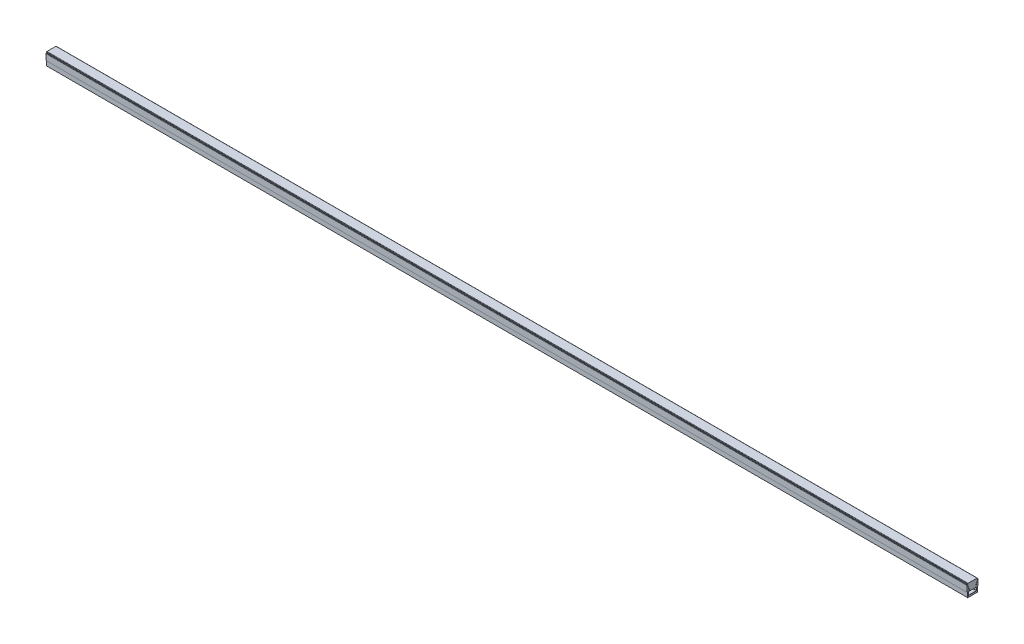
ISO-10303-21;
HEADER;
FILE_DESCRIPTION(('STEP AP214'),'2;1');
FILE_NAME('part.step','',(''),(''),'','','');
FILE_SCHEMA(('AUTOMOTIVE_DESIGN { 1 0 10303 214 1 1 1 1 }'));
ENDSEC;
DATA;
#1=APPLICATION_CONTEXT('core data for automotive mechanical design processes');
#2=APPLICATION_PROTOCOL_DEFINITION('international standard','automotive_design',2000,#1);
#3=PRODUCT_CONTEXT('',#1,'mechanical');
#4=PRODUCT('Part','Part','',(#3));
#5=PRODUCT_RELATED_PRODUCT_CATEGORY('part','',(#4));
#6=PRODUCT_DEFINITION_FORMATION('','',#4);
#7=PRODUCT_DEFINITION_CONTEXT('part definition',#1,'design');
#8=PRODUCT_DEFINITION('design','',#6,#7);
#9=PRODUCT_DEFINITION_SHAPE('','',#8);
#10=(LENGTH_UNIT() NAMED_UNIT(*) SI_UNIT(.MILLI.,.METRE.));
#11=(NAMED_UNIT(*) PLANE_ANGLE_UNIT() SI_UNIT($,.RADIAN.));
#12=(NAMED_UNIT(*) SI_UNIT($,.STERADIAN.) SOLID_ANGLE_UNIT());
#13=UNCERTAINTY_MEASURE_WITH_UNIT(LENGTH_MEASURE(1.E-05),#10,'distance_accuracy_value','');
#14=(GEOMETRIC_REPRESENTATION_CONTEXT(3) GLOBAL_UNCERTAINTY_ASSIGNED_CONTEXT((#13)) GLOBAL_UNIT_ASSIGNED_CONTEXT((#10,
#11,#12)) REPRESENTATION_CONTEXT('',''));
#15=CARTESIAN_POINT('',(0.,0.,0.));
#16=DIRECTION('',(0.,0.,1.));
#17=DIRECTION('',(1.,0.,0.));
#18=AXIS2_PLACEMENT_3D('',#15,#16,#17);
#19=CARTESIAN_POINT('',(254.,6.89999999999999,0.));
#20=DIRECTION('',(1.,0.,0.));
#21=DIRECTION('',(0.,0.,-1.));
#22=AXIS2_PLACEMENT_3D('',#19,#20,#21);
#23=PLANE('',#22);
#24=DIRECTION('',(0.,1.,0.));
#25=VECTOR('',#24,1.);
#26=CARTESIAN_POINT('',(254.,2.79999999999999,-1.76));
#27=LINE('',#26,#25);
#28=CARTESIAN_POINT('',(254.,2.79999999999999,-1.76));
#29=VERTEX_POINT('',#28);
#30=CARTESIAN_POINT('',(254.,3.6,-1.76));
#31=VERTEX_POINT('',#30);
#32=EDGE_CURVE('P0_E94',#29,#31,#27,.T.);
#33=ORIENTED_EDGE('',*,*,#32,.T.);
#34=CARTESIAN_POINT('',(254.,11.8065321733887,18.959853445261));
#35=DIRECTION('',(1.,0.,0.));
#36=DIRECTION('',(0.,0.,1.));
#37=AXIS2_PLACEMENT_3D('',#34,#35,#36);
#38=CIRCLE('',#37,22.285858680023);
#39=CARTESIAN_POINT('',(254.,6.39999999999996,-2.66025078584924));
#40=VERTEX_POINT('',#39);
#41=EDGE_CURVE('P0_E105',#31,#40,#38,.T.);
#42=ORIENTED_EDGE('',*,*,#41,.T.);
#43=DIRECTION('',(0.,-1.,0.));
#44=VECTOR('',#43,1.);
#45=CARTESIAN_POINT('',(254.,6.89999999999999,-2.66025078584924));
#46=LINE('',#45,#44);
#47=CARTESIAN_POINT('',(254.,6.69999999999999,-2.66025078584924));
#48=VERTEX_POINT('',#47);
#49=EDGE_CURVE('P0_E128',#48,#40,#46,.T.);
#50=ORIENTED_EDGE('',*,*,#49,.F.);
#51=CARTESIAN_POINT('',(254.,6.69999999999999,-2.46025078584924));
#52=DIRECTION('',(1.,0.,0.));
#53=DIRECTION('',(0.,0.,-1.));
#54=AXIS2_PLACEMENT_3D('',#51,#52,#53);
#55=CIRCLE('',#54,0.2);
#56=CARTESIAN_POINT('',(254.,6.89999999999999,-2.46025078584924));
#57=VERTEX_POINT('',#56);
#58=EDGE_CURVE('P0_E153',#48,#57,#55,.T.);
#59=ORIENTED_EDGE('',*,*,#58,.T.);
#60=DIRECTION('',(0.,0.,1.));
#61=VECTOR('',#60,1.);
#62=CARTESIAN_POINT('',(254.,6.89999999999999,0.));
#63=LINE('',#62,#61);
#64=CARTESIAN_POINT('',(254.,6.89999999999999,2.46025078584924));
#65=VERTEX_POINT('',#64);
#66=EDGE_CURVE('P0_E132',#57,#65,#63,.T.);
#67=ORIENTED_EDGE('',*,*,#66,.T.);
#68=CARTESIAN_POINT('',(254.,6.69999999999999,2.46025078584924));
#69=DIRECTION('',(1.,0.,0.));
#70=DIRECTION('',(0.,0.,-1.));
#71=AXIS2_PLACEMENT_3D('',#68,#69,#70);
#72=CIRCLE('',#71,0.2);
#73=CARTESIAN_POINT('',(254.,6.69999999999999,2.66025078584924));
#74=VERTEX_POINT('',#73);
#75=EDGE_CURVE('P0_E24',#65,#74,#72,.T.);
#76=ORIENTED_EDGE('',*,*,#75,.T.);
#77=DIRECTION('',(0.,-1.,0.));
#78=VECTOR('',#77,1.);
#79=CARTESIAN_POINT('',(254.,6.89999999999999,2.66025078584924));
#80=LINE('',#79,#78);
#81=CARTESIAN_POINT('',(254.,6.39999999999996,2.66025078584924));
#82=VERTEX_POINT('',#81);
#83=EDGE_CURVE('P0_E116',#74,#82,#80,.T.);
#84=ORIENTED_EDGE('',*,*,#83,.T.);
#85=CARTESIAN_POINT('',(254.,11.8065321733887,-18.959853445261));
#86=DIRECTION('',(-1.,0.,0.));
#87=DIRECTION('',(0.,0.,-1.));
#88=AXIS2_PLACEMENT_3D('',#85,#86,#87);
#89=CIRCLE('',#88,22.285858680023);
#90=CARTESIAN_POINT('',(254.,3.6,1.76));
#91=VERTEX_POINT('',#90);
#92=EDGE_CURVE('P0_E182',#91,#82,#89,.T.);
#93=ORIENTED_EDGE('',*,*,#92,.F.);
#94=DIRECTION('',(0.,1.,0.));
#95=VECTOR('',#94,1.);
#96=CARTESIAN_POINT('',(254.,2.79999999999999,1.76));
#97=LINE('',#96,#95);
#98=CARTESIAN_POINT('',(254.,2.79999999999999,1.76));
#99=VERTEX_POINT('',#98);
#100=EDGE_CURVE('P0_E112',#99,#91,#97,.T.);
#101=ORIENTED_EDGE('',*,*,#100,.F.);
#102=DIRECTION('',(0.,0.,-1.));
#103=VECTOR('',#102,1.);
#104=CARTESIAN_POINT('',(254.,2.79999999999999,1.75999999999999));
#105=LINE('',#104,#103);
#106=EDGE_CURVE('P0_E109',#99,#29,#105,.T.);
#107=ORIENTED_EDGE('',*,*,#106,.T.);
#108=EDGE_LOOP('',(#33,#42,#50,#59,#67,#76,#84,#93,#101,#107));
#109=FACE_BOUND('',#108,.T.);
#110=ADVANCED_FACE('P0_F16',(#109),#23,.T.);
#111=CARTESIAN_POINT('',(-254.,6.89999999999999,0.));
#112=DIRECTION('',(1.,0.,0.));
#113=DIRECTION('',(0.,0.,-1.));
#114=AXIS2_PLACEMENT_3D('',#111,#112,#113);
#115=PLANE('',#114);
#116=CARTESIAN_POINT('',(-254.,11.8065321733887,18.959853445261));
#117=DIRECTION('',(1.,0.,0.));
#118=DIRECTION('',(0.,0.,-1.));
#119=AXIS2_PLACEMENT_3D('',#116,#117,#118);
#120=CIRCLE('',#119,22.285858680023);
#121=CARTESIAN_POINT('',(-254.,6.39999999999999,-2.66025078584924));
#122=VERTEX_POINT('',#121);
#123=CARTESIAN_POINT('',(-254.,3.6,-1.76));
#124=VERTEX_POINT('',#123);
#125=EDGE_CURVE('P0_E188',#122,#124,#120,.F.);
#126=ORIENTED_EDGE('',*,*,#125,.T.);
#127=DIRECTION('',(0.,-1.,0.));
#128=VECTOR('',#127,1.);
#129=CARTESIAN_POINT('',(-254.,2.79999999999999,-1.76));
#130=LINE('',#129,#128);
#131=CARTESIAN_POINT('',(-254.,2.79999999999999,-1.76));
#132=VERTEX_POINT('',#131);
#133=EDGE_CURVE('P0_E185',#124,#132,#130,.T.);
#134=ORIENTED_EDGE('',*,*,#133,.T.);
#135=DIRECTION('',(0.,0.,-1.));
#136=VECTOR('',#135,1.);
#137=CARTESIAN_POINT('',(-254.,2.79999999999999,1.75999999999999));
#138=LINE('',#137,#136);
#139=CARTESIAN_POINT('',(-254.,2.79999999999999,1.76));
#140=VERTEX_POINT('',#139);
#141=EDGE_CURVE('P0_E121',#140,#132,#138,.T.);
#142=ORIENTED_EDGE('',*,*,#141,.F.);
#143=DIRECTION('',(0.,-1.,0.));
#144=VECTOR('',#143,1.);
#145=CARTESIAN_POINT('',(-254.,2.79999999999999,1.76));
#146=LINE('',#145,#144);
#147=CARTESIAN_POINT('',(-254.,3.6,1.76));
#148=VERTEX_POINT('',#147);
#149=EDGE_CURVE('P0_E177',#148,#140,#146,.T.);
#150=ORIENTED_EDGE('',*,*,#149,.F.);
#151=CARTESIAN_POINT('',(-254.,11.8065321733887,-18.959853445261));
#152=DIRECTION('',(1.,0.,0.));
#153=DIRECTION('',(0.,0.,-1.));
#154=AXIS2_PLACEMENT_3D('',#151,#152,#153);
#155=CIRCLE('',#154,22.285858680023);
#156=CARTESIAN_POINT('',(-254.,6.39999999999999,2.66025078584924));
#157=VERTEX_POINT('',#156);
#158=EDGE_CURVE('P0_E175',#157,#148,#155,.T.);
#159=ORIENTED_EDGE('',*,*,#158,.F.);
#160=DIRECTION('',(0.,-1.,0.));
#161=VECTOR('',#160,1.);
#162=CARTESIAN_POINT('',(-254.,6.89999999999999,2.66025078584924));
#163=LINE('',#162,#161);
#164=CARTESIAN_POINT('',(-254.,6.69999999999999,2.66025078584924));
#165=VERTEX_POINT('',#164);
#166=EDGE_CURVE('P0_E125',#165,#157,#163,.T.);
#167=ORIENTED_EDGE('',*,*,#166,.F.);
#168=CARTESIAN_POINT('',(-254.,6.69999999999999,2.46025078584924));
#169=DIRECTION('',(1.,0.,0.));
#170=DIRECTION('',(0.,0.,-1.));
#171=AXIS2_PLACEMENT_3D('',#168,#169,#170);
#172=CIRCLE('',#171,0.2);
#173=CARTESIAN_POINT('',(-254.,6.89999999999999,2.46025078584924));
#174=VERTEX_POINT('',#173);
#175=EDGE_CURVE('P0_E147',#165,#174,#172,.F.);
#176=ORIENTED_EDGE('',*,*,#175,.T.);
#177=DIRECTION('',(0.,0.,1.));
#178=VECTOR('',#177,1.);
#179=CARTESIAN_POINT('',(-254.,6.89999999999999,0.));
#180=LINE('',#179,#178);
#181=CARTESIAN_POINT('',(-254.,6.89999999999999,-2.46025078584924));
#182=VERTEX_POINT('',#181);
#183=EDGE_CURVE('P0_E122',#182,#174,#180,.T.);
#184=ORIENTED_EDGE('',*,*,#183,.F.);
#185=CARTESIAN_POINT('',(-254.,6.69999999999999,-2.46025078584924));
#186=DIRECTION('',(1.,0.,0.));
#187=DIRECTION('',(0.,0.,-1.));
#188=AXIS2_PLACEMENT_3D('',#185,#186,#187);
#189=CIRCLE('',#188,0.2);
#190=CARTESIAN_POINT('',(-254.,6.69999999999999,-2.66025078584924));
#191=VERTEX_POINT('',#190);
#192=EDGE_CURVE('P0_E145',#182,#191,#189,.F.);
#193=ORIENTED_EDGE('',*,*,#192,.T.);
#194=DIRECTION('',(0.,-1.,0.));
#195=VECTOR('',#194,1.);
#196=CARTESIAN_POINT('',(-254.,6.89999999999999,-2.66025078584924));
#197=LINE('',#196,#195);
#198=EDGE_CURVE('P0_E173',#191,#122,#197,.T.);
#199=ORIENTED_EDGE('',*,*,#198,.T.);
#200=EDGE_LOOP('',(#126,#134,#142,#150,#159,#167,#176,#184,#193,#199));
#201=FACE_BOUND('',#200,.T.);
#202=ADVANCED_FACE('P0_F166',(#201),#115,.F.);
#203=CARTESIAN_POINT('',(254.,6.89999999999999,0.));
#204=DIRECTION('',(0.,-1.,0.));
#205=DIRECTION('',(0.,0.,-1.));
#206=AXIS2_PLACEMENT_3D('',#203,#204,#205);
#207=PLANE('',#206);
#208=ORIENTED_EDGE('',*,*,#183,.T.);
#209=DIRECTION('',(-1.,0.,0.));
#210=VECTOR('',#209,1.);
#211=CARTESIAN_POINT('',(254.,6.89999999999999,2.46025078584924));
#212=LINE('',#211,#210);
#213=EDGE_CURVE('P0_E37',#174,#65,#212,.F.);
#214=ORIENTED_EDGE('',*,*,#213,.T.);
#215=ORIENTED_EDGE('',*,*,#66,.F.);
#216=DIRECTION('',(-1.,0.,0.));
#217=VECTOR('',#216,1.);
#218=CARTESIAN_POINT('',(-254.,6.89999999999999,-2.46025078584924));
#219=LINE('',#218,#217);
#220=EDGE_CURVE('P0_E149',#57,#182,#219,.T.);
#221=ORIENTED_EDGE('',*,*,#220,.T.);
#222=EDGE_LOOP('',(#208,#214,#215,#221));
#223=FACE_BOUND('',#222,.T.);
#224=ADVANCED_FACE('P0_F168',(#223),#207,.F.);
#225=CARTESIAN_POINT('',(254.,6.89999999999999,2.66025078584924));
#226=DIRECTION('',(0.,0.,-1.));
#227=DIRECTION('',(-1.,0.,0.));
#228=AXIS2_PLACEMENT_3D('',#225,#226,#227);
#229=PLANE('',#228);
#230=ORIENTED_EDGE('',*,*,#83,.F.);
#231=DIRECTION('',(-1.,0.,0.));
#232=VECTOR('',#231,1.);
#233=CARTESIAN_POINT('',(254.,6.69999999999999,2.66025078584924));
#234=LINE('',#233,#232);
#235=EDGE_CURVE('P0_E142',#74,#165,#234,.T.);
#236=ORIENTED_EDGE('',*,*,#235,.T.);
#237=ORIENTED_EDGE('',*,*,#166,.T.);
#238=DIRECTION('',(-1.,0.,0.));
#239=VECTOR('',#238,1.);
#240=CARTESIAN_POINT('',(254.,6.39999999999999,2.66025078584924));
#241=LINE('',#240,#239);
#242=EDGE_CURVE('P0_E140',#82,#157,#241,.T.);
#243=ORIENTED_EDGE('',*,*,#242,.F.);
#244=EDGE_LOOP('',(#230,#236,#237,#243));
#245=FACE_BOUND('',#244,.T.);
#246=ADVANCED_FACE('P0_F160',(#245),#229,.F.);
#247=CARTESIAN_POINT('',(254.,2.79999999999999,1.75999999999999));
#248=DIRECTION('',(0.,1.,0.));
#249=DIRECTION('',(0.,0.,1.));
#250=AXIS2_PLACEMENT_3D('',#247,#248,#249);
#251=PLANE('',#250);
#252=ORIENTED_EDGE('',*,*,#141,.T.);
#253=DIRECTION('',(-1.,0.,0.));
#254=VECTOR('',#253,1.);
#255=CARTESIAN_POINT('',(254.,2.79999999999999,-1.75999999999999));
#256=LINE('',#255,#254);
#257=EDGE_CURVE('P0_E98',#29,#132,#256,.T.);
#258=ORIENTED_EDGE('',*,*,#257,.F.);
#259=ORIENTED_EDGE('',*,*,#106,.F.);
#260=DIRECTION('',(-1.,0.,0.));
#261=VECTOR('',#260,1.);
#262=CARTESIAN_POINT('',(254.,2.79999999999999,1.75999999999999));
#263=LINE('',#262,#261);
#264=EDGE_CURVE('P0_E115',#99,#140,#263,.T.);
#265=ORIENTED_EDGE('',*,*,#264,.T.);
#266=EDGE_LOOP('',(#252,#258,#259,#265));
#267=FACE_BOUND('',#266,.T.);
#268=ADVANCED_FACE('P0_F119',(#267),#251,.F.);
#269=CARTESIAN_POINT('',(254.,6.89999999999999,-2.66025078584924));
#270=DIRECTION('',(0.,0.,-1.));
#271=DIRECTION('',(-1.,0.,0.));
#272=AXIS2_PLACEMENT_3D('',#269,#270,#271);
#273=PLANE('',#272);
#274=ORIENTED_EDGE('',*,*,#198,.F.);
#275=DIRECTION('',(-1.,0.,0.));
#276=VECTOR('',#275,1.);
#277=CARTESIAN_POINT('',(254.,6.69999999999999,-2.66025078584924));
#278=LINE('',#277,#276);
#279=EDGE_CURVE('P0_E11',#191,#48,#278,.F.);
#280=ORIENTED_EDGE('',*,*,#279,.T.);
#281=ORIENTED_EDGE('',*,*,#49,.T.);
#282=DIRECTION('',(-1.,0.,0.));
#283=VECTOR('',#282,1.);
#284=CARTESIAN_POINT('',(254.,6.39999999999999,-2.66025078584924));
#285=LINE('',#284,#283);
#286=EDGE_CURVE('P0_E123',#40,#122,#285,.T.);
#287=ORIENTED_EDGE('',*,*,#286,.T.);
#288=EDGE_LOOP('',(#274,#280,#281,#287));
#289=FACE_BOUND('',#288,.T.);
#290=ADVANCED_FACE('P0_F174',(#289),#273,.T.);
#291=CARTESIAN_POINT('',(254.,6.69999999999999,2.46025078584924));
#292=DIRECTION('',(-1.,0.,0.));
#293=DIRECTION('',(0.,0.,1.));
#294=AXIS2_PLACEMENT_3D('',#291,#292,#293);
#295=CYLINDRICAL_SURFACE('',#294,0.2);
#296=ORIENTED_EDGE('',*,*,#75,.F.);
#297=ORIENTED_EDGE('',*,*,#213,.F.);
#298=ORIENTED_EDGE('',*,*,#175,.F.);
#299=ORIENTED_EDGE('',*,*,#235,.F.);
#300=EDGE_LOOP('',(#296,#297,#298,#299));
#301=FACE_BOUND('',#300,.T.);
#302=ADVANCED_FACE('P0_F162',(#301),#295,.T.);
#303=CARTESIAN_POINT('',(254.,6.69999999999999,-2.46025078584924));
#304=DIRECTION('',(1.,0.,0.));
#305=DIRECTION('',(0.,0.,-1.));
#306=AXIS2_PLACEMENT_3D('',#303,#304,#305);
#307=CYLINDRICAL_SURFACE('',#306,0.2);
#308=ORIENTED_EDGE('',*,*,#58,.F.);
#309=ORIENTED_EDGE('',*,*,#279,.F.);
#310=ORIENTED_EDGE('',*,*,#192,.F.);
#311=ORIENTED_EDGE('',*,*,#220,.F.);
#312=EDGE_LOOP('',(#308,#309,#310,#311));
#313=FACE_BOUND('',#312,.T.);
#314=ADVANCED_FACE('P0_F18',(#313),#307,.T.);
#315=CARTESIAN_POINT('',(-257.710855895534,2.79999999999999,1.76));
#316=DIRECTION('',(0.,0.,-1.));
#317=DIRECTION('',(0.,1.,0.));
#318=AXIS2_PLACEMENT_3D('',#315,#316,#317);
#319=PLANE('',#318);
#320=ORIENTED_EDGE('',*,*,#149,.T.);
#321=ORIENTED_EDGE('',*,*,#264,.F.);
#322=ORIENTED_EDGE('',*,*,#100,.T.);
#323=DIRECTION('',(1.,0.,0.));
#324=VECTOR('',#323,1.);
#325=CARTESIAN_POINT('',(-257.710855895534,3.6,1.76));
#326=LINE('',#325,#324);
#327=EDGE_CURVE('P0_E180',#148,#91,#326,.T.);
#328=ORIENTED_EDGE('',*,*,#327,.F.);
#329=EDGE_LOOP('',(#320,#321,#322,#328));
#330=FACE_BOUND('',#329,.T.);
#331=ADVANCED_FACE('P0_F202',(#330),#319,.F.);
#332=CARTESIAN_POINT('',(-257.710855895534,11.8065321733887,-18.959853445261));
#333=DIRECTION('',(1.,0.,0.));
#334=DIRECTION('',(0.,0.,-1.));
#335=AXIS2_PLACEMENT_3D('',#332,#333,#334);
#336=CYLINDRICAL_SURFACE('',#335,22.285858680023);
#337=ORIENTED_EDGE('',*,*,#158,.T.);
#338=ORIENTED_EDGE('',*,*,#327,.T.);
#339=ORIENTED_EDGE('',*,*,#92,.T.);
#340=ORIENTED_EDGE('',*,*,#242,.T.);
#341=EDGE_LOOP('',(#337,#338,#339,#340));
#342=FACE_BOUND('',#341,.T.);
#343=ADVANCED_FACE('P0_F194',(#342),#336,.T.);
#344=CARTESIAN_POINT('',(-257.710855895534,11.8065321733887,18.959853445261));
#345=DIRECTION('',(1.,0.,0.));
#346=DIRECTION('',(0.,0.,-1.));
#347=AXIS2_PLACEMENT_3D('',#344,#345,#346);
#348=CYLINDRICAL_SURFACE('',#347,22.285858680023);
#349=ORIENTED_EDGE('',*,*,#286,.F.);
#350=ORIENTED_EDGE('',*,*,#41,.F.);
#351=DIRECTION('',(1.,0.,0.));
#352=VECTOR('',#351,1.);
#353=CARTESIAN_POINT('',(-257.710855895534,3.6,-1.76));
#354=LINE('',#353,#352);
#355=EDGE_CURVE('P0_E101',#124,#31,#354,.T.);
#356=ORIENTED_EDGE('',*,*,#355,.F.);
#357=ORIENTED_EDGE('',*,*,#125,.F.);
#358=EDGE_LOOP('',(#349,#350,#356,#357));
#359=FACE_BOUND('',#358,.T.);
#360=ADVANCED_FACE('P0_F192',(#359),#348,.T.);
#361=CARTESIAN_POINT('',(-257.710855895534,2.79999999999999,-1.76));
#362=DIRECTION('',(0.,0.,-1.));
#363=DIRECTION('',(0.,1.,0.));
#364=AXIS2_PLACEMENT_3D('',#361,#362,#363);
#365=PLANE('',#364);
#366=ORIENTED_EDGE('',*,*,#355,.T.);
#367=ORIENTED_EDGE('',*,*,#32,.F.);
#368=ORIENTED_EDGE('',*,*,#257,.T.);
#369=ORIENTED_EDGE('',*,*,#133,.F.);
#370=EDGE_LOOP('',(#366,#367,#368,#369));
#371=FACE_BOUND('',#370,.T.);
#372=ADVANCED_FACE('P0_F96',(#371),#365,.T.);
#373=CLOSED_SHELL('',(#110,#202,#224,#246,#268,#290,#302,#314,#331,#343,#360,#372));
#374=MANIFOLD_SOLID_BREP('P0_B1',#373);
#375=CARTESIAN_POINT('',(-254.,0.,0.));
#376=DIRECTION('',(-1.,0.,0.));
#377=DIRECTION('',(0.,0.,1.));
#378=AXIS2_PLACEMENT_3D('',#375,#376,#377);
#379=PLANE('',#378);
#380=CARTESIAN_POINT('',(-254.,6.15,-2.8451941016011));
#381=DIRECTION('',(-1.,0.,0.));
#382=DIRECTION('',(0.,0.,1.));
#383=AXIS2_PLACEMENT_3D('',#380,#381,#382);
#384=CIRCLE('',#383,0.25);
#385=CARTESIAN_POINT('',(-254.,6.34402850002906,-2.68754594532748));
#386=VERTEX_POINT('',#385);
#387=CARTESIAN_POINT('',(-254.,6.39897665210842,-2.82259705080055));
#388=VERTEX_POINT('',#387);
#389=EDGE_CURVE('P1_E813',#386,#388,#384,.T.);
#390=ORIENTED_EDGE('',*,*,#389,.T.);
#391=CARTESIAN_POINT('',(-254.,6.15,-2.8));
#392=DIRECTION('',(-1.,0.,0.));
#393=DIRECTION('',(0.,0.,1.));
#394=AXIS2_PLACEMENT_3D('',#391,#392,#393);
#395=CIRCLE('',#394,0.25);
#396=CARTESIAN_POINT('',(-254.,6.2999999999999,-3.00000000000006));
#397=VERTEX_POINT('',#396);
#398=EDGE_CURVE('P1_E815',#388,#397,#395,.T.);
#399=ORIENTED_EDGE('',*,*,#398,.T.);
#400=DIRECTION('',(0.,-1.,0.));
#401=VECTOR('',#400,1.);
#402=CARTESIAN_POINT('',(-254.,0.,-3.00000000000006));
#403=LINE('',#402,#401);
#404=CARTESIAN_POINT('',(-254.,2.84999999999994,-3.00000000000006));
#405=VERTEX_POINT('',#404);
#406=EDGE_CURVE('P1_E486',#397,#405,#403,.T.);
#407=ORIENTED_EDGE('',*,*,#406,.T.);
#408=DIRECTION('',(0.,0.,1.));
#409=VECTOR('',#408,1.);
#410=CARTESIAN_POINT('',(-254.,2.84999999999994,0.));
#411=LINE('',#410,#409);
#412=CARTESIAN_POINT('',(-254.,2.84999999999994,-2.69999999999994));
#413=VERTEX_POINT('',#412);
#414=EDGE_CURVE('P1_E484',#405,#413,#411,.T.);
#415=ORIENTED_EDGE('',*,*,#414,.T.);
#416=DIRECTION('',(0.,0.707106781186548,-0.707106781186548));
#417=VECTOR('',#416,1.);
#418=CARTESIAN_POINT('',(-254.,0.0750000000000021,0.0750000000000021));
#419=LINE('',#418,#417);
#420=CARTESIAN_POINT('',(-254.,2.8,-2.65));
#421=VERTEX_POINT('',#420);
#422=EDGE_CURVE('P1_E481',#421,#413,#419,.T.);
#423=ORIENTED_EDGE('',*,*,#422,.F.);
#424=DIRECTION('',(0.,0.707106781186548,-0.707106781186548));
#425=VECTOR('',#424,1.);
#426=CARTESIAN_POINT('',(-254.,0.0750000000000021,0.0750000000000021));
#427=LINE('',#426,#425);
#428=CARTESIAN_POINT('',(-254.,2.75000000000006,-2.60000000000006));
#429=VERTEX_POINT('',#428);
#430=EDGE_CURVE('P1_E478',#429,#421,#427,.T.);
#431=ORIENTED_EDGE('',*,*,#430,.F.);
#432=DIRECTION('',(0.,-1.,0.));
#433=VECTOR('',#432,1.);
#434=CARTESIAN_POINT('',(-254.,0.,-2.60000000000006));
#435=LINE('',#434,#433);
#436=CARTESIAN_POINT('',(-254.,0.0499999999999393,-2.60000000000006));
#437=VERTEX_POINT('',#436);
#438=EDGE_CURVE('P1_E476',#429,#437,#435,.T.);
#439=ORIENTED_EDGE('',*,*,#438,.T.);
#440=DIRECTION('',(0.,0.,1.));
#441=VECTOR('',#440,1.);
#442=CARTESIAN_POINT('',(-254.,0.0499999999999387,2.65));
#443=LINE('',#442,#441);
#444=CARTESIAN_POINT('',(-254.,0.0499999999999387,2.60000000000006));
#445=VERTEX_POINT('',#444);
#446=EDGE_CURVE('P1_E474',#437,#445,#443,.T.);
#447=ORIENTED_EDGE('',*,*,#446,.T.);
#448=DIRECTION('',(0.,1.,0.));
#449=VECTOR('',#448,1.);
#450=CARTESIAN_POINT('',(-254.,2.8,2.60000000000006));
#451=LINE('',#450,#449);
#452=CARTESIAN_POINT('',(-254.,2.75000000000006,2.60000000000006));
#453=VERTEX_POINT('',#452);
#454=EDGE_CURVE('P1_E472',#445,#453,#451,.T.);
#455=ORIENTED_EDGE('',*,*,#454,.T.);
#456=DIRECTION('',(0.,-0.707106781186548,-0.707106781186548));
#457=VECTOR('',#456,1.);
#458=CARTESIAN_POINT('',(-254.,0.0750000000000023,-0.0750000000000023));
#459=LINE('',#458,#457);
#460=CARTESIAN_POINT('',(-254.,2.8,2.65));
#461=VERTEX_POINT('',#460);
#462=EDGE_CURVE('P1_E469',#461,#453,#459,.T.);
#463=ORIENTED_EDGE('',*,*,#462,.F.);
#464=DIRECTION('',(0.,-0.707106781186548,-0.707106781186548));
#465=VECTOR('',#464,1.);
#466=CARTESIAN_POINT('',(-254.,0.0750000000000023,-0.0750000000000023));
#467=LINE('',#466,#465);
#468=CARTESIAN_POINT('',(-254.,2.84999999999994,2.69999999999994));
#469=VERTEX_POINT('',#468);
#470=EDGE_CURVE('P1_E466',#469,#461,#467,.T.);
#471=ORIENTED_EDGE('',*,*,#470,.F.);
#472=DIRECTION('',(0.,0.,1.));
#473=VECTOR('',#472,1.);
#474=CARTESIAN_POINT('',(-254.,2.84999999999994,3.05));
#475=LINE('',#474,#473);
#476=CARTESIAN_POINT('',(-254.,2.84999999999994,3.00000000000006));
#477=VERTEX_POINT('',#476);
#478=EDGE_CURVE('P1_E464',#469,#477,#475,.T.);
#479=ORIENTED_EDGE('',*,*,#478,.T.);
#480=DIRECTION('',(0.,1.,0.));
#481=VECTOR('',#480,1.);
#482=CARTESIAN_POINT('',(-254.,6.4,3.00000000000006));
#483=LINE('',#482,#481);
#484=CARTESIAN_POINT('',(-254.,6.29999999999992,3.00000000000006));
#485=VERTEX_POINT('',#484);
#486=EDGE_CURVE('P1_E461',#477,#485,#483,.T.);
#487=ORIENTED_EDGE('',*,*,#486,.T.);
#488=CARTESIAN_POINT('',(-254.,6.15,2.8));
#489=DIRECTION('',(-1.,0.,0.));
#490=DIRECTION('',(0.,0.,1.));
#491=AXIS2_PLACEMENT_3D('',#488,#489,#490);
#492=CIRCLE('',#491,0.25);
#493=CARTESIAN_POINT('',(-254.,6.39897665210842,2.82259705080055));
#494=VERTEX_POINT('',#493);
#495=EDGE_CURVE('P1_E811',#485,#494,#492,.T.);
#496=ORIENTED_EDGE('',*,*,#495,.T.);
#497=CARTESIAN_POINT('',(-254.,6.15,2.8451941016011));
#498=DIRECTION('',(-1.,0.,0.));
#499=DIRECTION('',(0.,0.,1.));
#500=AXIS2_PLACEMENT_3D('',#497,#498,#499);
#501=CIRCLE('',#500,0.25);
#502=CARTESIAN_POINT('',(-254.,6.34402850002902,2.68754594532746));
#503=VERTEX_POINT('',#502);
#504=EDGE_CURVE('P1_E604',#494,#503,#501,.T.);
#505=ORIENTED_EDGE('',*,*,#504,.T.);
#506=DIRECTION('',(0.,-0.970142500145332,-0.242535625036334));
#507=VECTOR('',#506,1.);
#508=CARTESIAN_POINT('',(-254.,2.78787321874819,1.79850712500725));
#509=LINE('',#508,#507);
#510=CARTESIAN_POINT('',(-254.,2.84999999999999,1.8140388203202));
#511=VERTEX_POINT('',#510);
#512=EDGE_CURVE('P1_E488',#503,#511,#509,.T.);
#513=ORIENTED_EDGE('',*,*,#512,.T.);
#514=DIRECTION('',(0.,0.,1.));
#515=VECTOR('',#514,1.);
#516=CARTESIAN_POINT('',(-254.,2.84999999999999,2.15));
#517=LINE('',#516,#515);
#518=CARTESIAN_POINT('',(-254.,2.84999999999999,2.10000000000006));
#519=VERTEX_POINT('',#518);
#520=EDGE_CURVE('P1_E490',#511,#519,#517,.T.);
#521=ORIENTED_EDGE('',*,*,#520,.T.);
#522=DIRECTION('',(0.,0.707106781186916,-0.70710678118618));
#523=VECTOR('',#522,1.);
#524=CARTESIAN_POINT('',(-254.,2.47499999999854,2.47500000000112));
#525=LINE('',#524,#523);
#526=CARTESIAN_POINT('',(-254.,2.8,2.15));
#527=VERTEX_POINT('',#526);
#528=EDGE_CURVE('P1_E492',#527,#519,#525,.T.);
#529=ORIENTED_EDGE('',*,*,#528,.F.);
#530=DIRECTION('',(0.,0.707106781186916,-0.70710678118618));
#531=VECTOR('',#530,1.);
#532=CARTESIAN_POINT('',(-254.,2.47499999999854,2.47500000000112));
#533=LINE('',#532,#531);
#534=CARTESIAN_POINT('',(-254.,2.75000000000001,2.19999999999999));
#535=VERTEX_POINT('',#534);
#536=EDGE_CURVE('P1_E495',#535,#527,#533,.T.);
#537=ORIENTED_EDGE('',*,*,#536,.F.);
#538=DIRECTION('',(0.,-1.,0.));
#539=VECTOR('',#538,1.);
#540=CARTESIAN_POINT('',(-254.,1.,2.19999999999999));
#541=LINE('',#540,#539);
#542=CARTESIAN_POINT('',(-254.,1.04999999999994,2.19999999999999));
#543=VERTEX_POINT('',#542);
#544=EDGE_CURVE('P1_E498',#535,#543,#541,.T.);
#545=ORIENTED_EDGE('',*,*,#544,.T.);
#546=DIRECTION('',(0.,0.70710678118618,0.707106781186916));
#547=VECTOR('',#546,1.);
#548=CARTESIAN_POINT('',(-254.,-0.574999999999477,0.574999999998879));
#549=LINE('',#548,#547);
#550=CARTESIAN_POINT('',(-254.,1.,2.15));
#551=VERTEX_POINT('',#550);
#552=EDGE_CURVE('P1_E500',#551,#543,#549,.T.);
#553=ORIENTED_EDGE('',*,*,#552,.F.);
#554=DIRECTION('',(0.,0.70710678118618,0.707106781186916));
#555=VECTOR('',#554,1.);
#556=CARTESIAN_POINT('',(-254.,-0.574999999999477,0.574999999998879));
#557=LINE('',#556,#555);
#558=CARTESIAN_POINT('',(-254.,0.950000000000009,2.1));
#559=VERTEX_POINT('',#558);
#560=EDGE_CURVE('P1_E503',#559,#551,#557,.T.);
#561=ORIENTED_EDGE('',*,*,#560,.F.);
#562=DIRECTION('',(0.,0.,-1.));
#563=VECTOR('',#562,1.);
#564=CARTESIAN_POINT('',(-254.,0.950000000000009,-2.15));
#565=LINE('',#564,#563);
#566=CARTESIAN_POINT('',(-254.,0.950000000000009,-2.10000000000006));
#567=VERTEX_POINT('',#566);
#568=EDGE_CURVE('P1_E506',#559,#567,#565,.T.);
#569=ORIENTED_EDGE('',*,*,#568,.T.);
#570=DIRECTION('',(0.,-0.707106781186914,0.707106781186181));
#571=VECTOR('',#570,1.);
#572=CARTESIAN_POINT('',(-254.,-0.575000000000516,-0.575000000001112));
#573=LINE('',#572,#571);
#574=CARTESIAN_POINT('',(-254.,1.,-2.15));
#575=VERTEX_POINT('',#574);
#576=EDGE_CURVE('P1_E508',#575,#567,#573,.T.);
#577=ORIENTED_EDGE('',*,*,#576,.F.);
#578=DIRECTION('',(0.,-0.707106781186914,0.707106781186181));
#579=VECTOR('',#578,1.);
#580=CARTESIAN_POINT('',(-254.,-0.575000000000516,-0.575000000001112));
#581=LINE('',#580,#579);
#582=CARTESIAN_POINT('',(-254.,1.04999999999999,-2.19999999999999));
#583=VERTEX_POINT('',#582);
#584=EDGE_CURVE('P1_E511',#583,#575,#581,.T.);
#585=ORIENTED_EDGE('',*,*,#584,.F.);
#586=DIRECTION('',(0.,1.,0.));
#587=VECTOR('',#586,1.);
#588=CARTESIAN_POINT('',(-254.,0.,-2.19999999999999));
#589=LINE('',#588,#587);
#590=CARTESIAN_POINT('',(-254.,2.75000000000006,-2.19999999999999));
#591=VERTEX_POINT('',#590);
#592=EDGE_CURVE('P1_E514',#583,#591,#589,.T.);
#593=ORIENTED_EDGE('',*,*,#592,.T.);
#594=DIRECTION('',(0.,-0.70710678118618,-0.707106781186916));
#595=VECTOR('',#594,1.);
#596=CARTESIAN_POINT('',(-254.,2.47500000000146,-2.47499999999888));
#597=LINE('',#596,#595);
#598=CARTESIAN_POINT('',(-254.,2.8,-2.15));
#599=VERTEX_POINT('',#598);
#600=EDGE_CURVE('P1_E516',#599,#591,#597,.T.);
#601=ORIENTED_EDGE('',*,*,#600,.F.);
#602=DIRECTION('',(0.,-0.70710678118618,-0.707106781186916));
#603=VECTOR('',#602,1.);
#604=CARTESIAN_POINT('',(-254.,2.47500000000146,-2.47499999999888));
#605=LINE('',#604,#603);
#606=CARTESIAN_POINT('',(-254.,2.84999999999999,-2.1));
#607=VERTEX_POINT('',#606);
#608=EDGE_CURVE('P1_E519',#607,#599,#605,.T.);
#609=ORIENTED_EDGE('',*,*,#608,.F.);
#610=DIRECTION('',(0.,0.,1.));
#611=VECTOR('',#610,1.);
#612=CARTESIAN_POINT('',(-254.,2.84999999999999,0.));
#613=LINE('',#612,#611);
#614=CARTESIAN_POINT('',(-254.,2.84999999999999,-1.8140388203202));
#615=VERTEX_POINT('',#614);
#616=EDGE_CURVE('P1_E522',#607,#615,#613,.T.);
#617=ORIENTED_EDGE('',*,*,#616,.T.);
#618=DIRECTION('',(0.,0.970142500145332,-0.242535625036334));
#619=VECTOR('',#618,1.);
#620=CARTESIAN_POINT('',(-254.,-0.259185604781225,-1.03674241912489));
#621=LINE('',#620,#619);
#622=EDGE_CURVE('P1_E524',#615,#386,#621,.T.);
#623=ORIENTED_EDGE('',*,*,#622,.T.);
#624=EDGE_LOOP('',(#390,#399,#407,#415,#423,#431,#439,#447,#455,#463,#471,#479,#487,#496,#505,
#513,#521,#529,#537,#545,#553,#561,#569,#577,#585,#593,#601,#609,#617,#623));
#625=FACE_BOUND('',#624,.T.);
#626=ADVANCED_FACE('P1_F15',(#625),#379,.T.);
#627=CARTESIAN_POINT('',(254.,0.,0.));
#628=DIRECTION('',(-1.,0.,0.));
#629=DIRECTION('',(0.,0.,1.));
#630=AXIS2_PLACEMENT_3D('',#627,#628,#629);
#631=PLANE('',#630);
#632=DIRECTION('',(0.,1.,0.));
#633=VECTOR('',#632,1.);
#634=CARTESIAN_POINT('',(254.,6.4,-3.00000000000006));
#635=LINE('',#634,#633);
#636=CARTESIAN_POINT('',(254.,2.84999999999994,-3.00000000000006));
#637=VERTEX_POINT('',#636);
#638=CARTESIAN_POINT('',(254.,6.29999999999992,-3.00000000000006));
#639=VERTEX_POINT('',#638);
#640=EDGE_CURVE('P1_E399',#637,#639,#635,.T.);
#641=ORIENTED_EDGE('',*,*,#640,.T.);
#642=CARTESIAN_POINT('',(254.,6.15,-2.8));
#643=DIRECTION('',(-1.,0.,0.));
#644=DIRECTION('',(0.,0.,1.));
#645=AXIS2_PLACEMENT_3D('',#642,#643,#644);
#646=CIRCLE('',#645,0.25);
#647=CARTESIAN_POINT('',(254.,6.39897665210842,-2.82259705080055));
#648=VERTEX_POINT('',#647);
#649=EDGE_CURVE('P1_E830',#639,#648,#646,.F.);
#650=ORIENTED_EDGE('',*,*,#649,.T.);
#651=CARTESIAN_POINT('',(254.,6.15,-2.8451941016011));
#652=DIRECTION('',(-1.,0.,0.));
#653=DIRECTION('',(0.,0.,1.));
#654=AXIS2_PLACEMENT_3D('',#651,#652,#653);
#655=CIRCLE('',#654,0.25);
#656=CARTESIAN_POINT('',(254.,6.34402850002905,-2.68754594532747));
#657=VERTEX_POINT('',#656);
#658=EDGE_CURVE('P1_E828',#648,#657,#655,.F.);
#659=ORIENTED_EDGE('',*,*,#658,.T.);
#660=DIRECTION('',(0.,-0.970142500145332,0.242535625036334));
#661=VECTOR('',#660,1.);
#662=CARTESIAN_POINT('',(254.,2.78787321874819,-1.79850712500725));
#663=LINE('',#662,#661);
#664=CARTESIAN_POINT('',(254.,2.84999999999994,-1.81403882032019));
#665=VERTEX_POINT('',#664);
#666=EDGE_CURVE('P1_E430',#657,#665,#663,.T.);
#667=ORIENTED_EDGE('',*,*,#666,.T.);
#668=DIRECTION('',(0.,0.,-1.));
#669=VECTOR('',#668,1.);
#670=CARTESIAN_POINT('',(254.,2.84999999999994,-2.15));
#671=LINE('',#670,#669);
#672=CARTESIAN_POINT('',(254.,2.84999999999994,-2.1));
#673=VERTEX_POINT('',#672);
#674=EDGE_CURVE('P1_E426',#665,#673,#671,.T.);
#675=ORIENTED_EDGE('',*,*,#674,.T.);
#676=DIRECTION('',(0.,0.70710678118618,0.707106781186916));
#677=VECTOR('',#676,1.);
#678=CARTESIAN_POINT('',(254.,2.8499999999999,-2.10000000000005));
#679=LINE('',#678,#677);
#680=CARTESIAN_POINT('',(254.,2.8,-2.15));
#681=VERTEX_POINT('',#680);
#682=EDGE_CURVE('P1_E423',#681,#673,#679,.T.);
#683=ORIENTED_EDGE('',*,*,#682,.F.);
#684=DIRECTION('',(0.,0.70710678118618,0.707106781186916));
#685=VECTOR('',#684,1.);
#686=CARTESIAN_POINT('',(254.,2.8499999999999,-2.10000000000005));
#687=LINE('',#686,#685);
#688=CARTESIAN_POINT('',(254.,2.75000000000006,-2.19999999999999));
#689=VERTEX_POINT('',#688);
#690=EDGE_CURVE('P1_E414',#689,#681,#687,.T.);
#691=ORIENTED_EDGE('',*,*,#690,.F.);
#692=DIRECTION('',(0.,-1.,0.));
#693=VECTOR('',#692,1.);
#694=CARTESIAN_POINT('',(254.,1.,-2.19999999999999));
#695=LINE('',#694,#693);
#696=CARTESIAN_POINT('',(254.,1.04999999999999,-2.19999999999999));
#697=VERTEX_POINT('',#696);
#698=EDGE_CURVE('P1_E410',#689,#697,#695,.T.);
#699=ORIENTED_EDGE('',*,*,#698,.T.);
#700=DIRECTION('',(0.,0.707106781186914,-0.707106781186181));
#701=VECTOR('',#700,1.);
#702=CARTESIAN_POINT('',(254.,1.04999999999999,-2.19999999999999));
#703=LINE('',#702,#701);
#704=CARTESIAN_POINT('',(254.,1.,-2.15));
#705=VERTEX_POINT('',#704);
#706=EDGE_CURVE('P1_E404',#705,#697,#703,.T.);
#707=ORIENTED_EDGE('',*,*,#706,.F.);
#708=DIRECTION('',(0.,0.707106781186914,-0.707106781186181));
#709=VECTOR('',#708,1.);
#710=CARTESIAN_POINT('',(254.,1.04999999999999,-2.19999999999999));
#711=LINE('',#710,#709);
#712=CARTESIAN_POINT('',(254.,0.950000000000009,-2.10000000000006));
#713=VERTEX_POINT('',#712);
#714=EDGE_CURVE('P1_E407',#713,#705,#711,.T.);
#715=ORIENTED_EDGE('',*,*,#714,.F.);
#716=DIRECTION('',(0.,0.,1.));
#717=VECTOR('',#716,1.);
#718=CARTESIAN_POINT('',(254.,0.950000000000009,0.));
#719=LINE('',#718,#717);
#720=CARTESIAN_POINT('',(254.,0.950000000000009,2.1));
#721=VERTEX_POINT('',#720);
#722=EDGE_CURVE('P1_E412',#713,#721,#719,.T.);
#723=ORIENTED_EDGE('',*,*,#722,.T.);
#724=DIRECTION('',(0.,-0.70710678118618,-0.707106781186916));
#725=VECTOR('',#724,1.);
#726=CARTESIAN_POINT('',(254.,0.950000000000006,2.1));
#727=LINE('',#726,#725);
#728=CARTESIAN_POINT('',(254.,1.,2.15));
#729=VERTEX_POINT('',#728);
#730=EDGE_CURVE('P1_E417',#729,#721,#727,.T.);
#731=ORIENTED_EDGE('',*,*,#730,.F.);
#732=DIRECTION('',(0.,-0.70710678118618,-0.707106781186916));
#733=VECTOR('',#732,1.);
#734=CARTESIAN_POINT('',(254.,0.950000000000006,2.1));
#735=LINE('',#734,#733);
#736=CARTESIAN_POINT('',(254.,1.04999999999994,2.19999999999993));
#737=VERTEX_POINT('',#736);
#738=EDGE_CURVE('P1_E420',#737,#729,#735,.T.);
#739=ORIENTED_EDGE('',*,*,#738,.F.);
#740=DIRECTION('',(0.,1.,0.));
#741=VECTOR('',#740,1.);
#742=CARTESIAN_POINT('',(254.,0.,2.19999999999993));
#743=LINE('',#742,#741);
#744=CARTESIAN_POINT('',(254.,2.75000000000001,2.19999999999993));
#745=VERTEX_POINT('',#744);
#746=EDGE_CURVE('P1_E428',#737,#745,#743,.T.);
#747=ORIENTED_EDGE('',*,*,#746,.T.);
#748=DIRECTION('',(0.,-0.707106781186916,0.70710678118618));
#749=VECTOR('',#748,1.);
#750=CARTESIAN_POINT('',(254.,2.75000000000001,2.19999999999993));
#751=LINE('',#750,#749);
#752=CARTESIAN_POINT('',(254.,2.8,2.15));
#753=VERTEX_POINT('',#752);
#754=EDGE_CURVE('P1_E432',#753,#745,#751,.T.);
#755=ORIENTED_EDGE('',*,*,#754,.F.);
#756=DIRECTION('',(0.,-0.707106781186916,0.70710678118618));
#757=VECTOR('',#756,1.);
#758=CARTESIAN_POINT('',(254.,2.75000000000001,2.19999999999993));
#759=LINE('',#758,#757);
#760=CARTESIAN_POINT('',(254.,2.84999999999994,2.10000000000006));
#761=VERTEX_POINT('',#760);
#762=EDGE_CURVE('P1_E435',#761,#753,#759,.T.);
#763=ORIENTED_EDGE('',*,*,#762,.F.);
#764=DIRECTION('',(0.,0.,-1.));
#765=VECTOR('',#764,1.);
#766=CARTESIAN_POINT('',(254.,2.84999999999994,0.));
#767=LINE('',#766,#765);
#768=CARTESIAN_POINT('',(254.,2.84999999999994,1.81403882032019));
#769=VERTEX_POINT('',#768);
#770=EDGE_CURVE('P1_E438',#761,#769,#767,.T.);
#771=ORIENTED_EDGE('',*,*,#770,.T.);
#772=DIRECTION('',(0.,0.970142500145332,0.242535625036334));
#773=VECTOR('',#772,1.);
#774=CARTESIAN_POINT('',(254.,-0.259185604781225,1.03674241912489));
#775=LINE('',#774,#773);
#776=CARTESIAN_POINT('',(254.,6.34402850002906,2.68754594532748));
#777=VERTEX_POINT('',#776);
#778=EDGE_CURVE('P1_E440',#769,#777,#775,.T.);
#779=ORIENTED_EDGE('',*,*,#778,.T.);
#780=CARTESIAN_POINT('',(254.,6.15,2.8451941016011));
#781=DIRECTION('',(-1.,0.,0.));
#782=DIRECTION('',(0.,0.,1.));
#783=AXIS2_PLACEMENT_3D('',#780,#781,#782);
#784=CIRCLE('',#783,0.25);
#785=CARTESIAN_POINT('',(254.,6.39897665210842,2.82259705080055));
#786=VERTEX_POINT('',#785);
#787=EDGE_CURVE('P1_E824',#777,#786,#784,.F.);
#788=ORIENTED_EDGE('',*,*,#787,.T.);
#789=CARTESIAN_POINT('',(254.,6.15,2.8));
#790=DIRECTION('',(-1.,0.,0.));
#791=DIRECTION('',(0.,0.,1.));
#792=AXIS2_PLACEMENT_3D('',#789,#790,#791);
#793=CIRCLE('',#792,0.25);
#794=CARTESIAN_POINT('',(254.,6.2999999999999,3.00000000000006));
#795=VERTEX_POINT('',#794);
#796=EDGE_CURVE('P1_E826',#786,#795,#793,.F.);
#797=ORIENTED_EDGE('',*,*,#796,.T.);
#798=DIRECTION('',(0.,-1.,0.));
#799=VECTOR('',#798,1.);
#800=CARTESIAN_POINT('',(254.,0.,3.00000000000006));
#801=LINE('',#800,#799);
#802=CARTESIAN_POINT('',(254.,2.84999999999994,3.00000000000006));
#803=VERTEX_POINT('',#802);
#804=EDGE_CURVE('P1_E896',#795,#803,#801,.T.);
#805=ORIENTED_EDGE('',*,*,#804,.T.);
#806=DIRECTION('',(0.,0.,-1.));
#807=VECTOR('',#806,1.);
#808=CARTESIAN_POINT('',(254.,2.84999999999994,0.));
#809=LINE('',#808,#807);
#810=CARTESIAN_POINT('',(254.,2.84999999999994,2.69999999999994));
#811=VERTEX_POINT('',#810);
#812=EDGE_CURVE('P1_E898',#803,#811,#809,.T.);
#813=ORIENTED_EDGE('',*,*,#812,.T.);
#814=DIRECTION('',(0.,0.707106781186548,0.707106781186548));
#815=VECTOR('',#814,1.);
#816=CARTESIAN_POINT('',(254.,2.84999999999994,2.69999999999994));
#817=LINE('',#816,#815);
#818=CARTESIAN_POINT('',(254.,2.8,2.65));
#819=VERTEX_POINT('',#818);
#820=EDGE_CURVE('P1_E901',#819,#811,#817,.T.);
#821=ORIENTED_EDGE('',*,*,#820,.F.);
#822=DIRECTION('',(0.,0.707106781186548,0.707106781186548));
#823=VECTOR('',#822,1.);
#824=CARTESIAN_POINT('',(254.,2.84999999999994,2.69999999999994));
#825=LINE('',#824,#823);
#826=CARTESIAN_POINT('',(254.,2.75000000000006,2.60000000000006));
#827=VERTEX_POINT('',#826);
#828=EDGE_CURVE('P1_E904',#827,#819,#825,.T.);
#829=ORIENTED_EDGE('',*,*,#828,.F.);
#830=DIRECTION('',(0.,-1.,0.));
#831=VECTOR('',#830,1.);
#832=CARTESIAN_POINT('',(254.,0.,2.60000000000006));
#833=LINE('',#832,#831);
#834=CARTESIAN_POINT('',(254.,0.0499999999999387,2.60000000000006));
#835=VERTEX_POINT('',#834);
#836=EDGE_CURVE('P1_E907',#827,#835,#833,.T.);
#837=ORIENTED_EDGE('',*,*,#836,.T.);
#838=DIRECTION('',(0.,0.,-1.));
#839=VECTOR('',#838,1.);
#840=CARTESIAN_POINT('',(254.,0.049999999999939,0.));
#841=LINE('',#840,#839);
#842=CARTESIAN_POINT('',(254.,0.0499999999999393,-2.60000000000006));
#843=VERTEX_POINT('',#842);
#844=EDGE_CURVE('P1_E909',#835,#843,#841,.T.);
#845=ORIENTED_EDGE('',*,*,#844,.T.);
#846=DIRECTION('',(0.,1.,0.));
#847=VECTOR('',#846,1.);
#848=CARTESIAN_POINT('',(254.,2.8,-2.60000000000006));
#849=LINE('',#848,#847);
#850=CARTESIAN_POINT('',(254.,2.75000000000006,-2.60000000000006));
#851=VERTEX_POINT('',#850);
#852=EDGE_CURVE('P1_E388',#843,#851,#849,.T.);
#853=ORIENTED_EDGE('',*,*,#852,.T.);
#854=DIRECTION('',(0.,-0.707106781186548,0.707106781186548));
#855=VECTOR('',#854,1.);
#856=CARTESIAN_POINT('',(254.,2.75000000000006,-2.60000000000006));
#857=LINE('',#856,#855);
#858=CARTESIAN_POINT('',(254.,2.8,-2.65));
#859=VERTEX_POINT('',#858);
#860=EDGE_CURVE('P1_E381',#859,#851,#857,.T.);
#861=ORIENTED_EDGE('',*,*,#860,.F.);
#862=DIRECTION('',(0.,-0.707106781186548,0.707106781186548));
#863=VECTOR('',#862,1.);
#864=CARTESIAN_POINT('',(254.,2.75000000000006,-2.60000000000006));
#865=LINE('',#864,#863);
#866=CARTESIAN_POINT('',(254.,2.84999999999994,-2.69999999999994));
#867=VERTEX_POINT('',#866);
#868=EDGE_CURVE('P1_E385',#867,#859,#865,.T.);
#869=ORIENTED_EDGE('',*,*,#868,.F.);
#870=DIRECTION('',(0.,0.,-1.));
#871=VECTOR('',#870,1.);
#872=CARTESIAN_POINT('',(254.,2.84999999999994,-3.05));
#873=LINE('',#872,#871);
#874=EDGE_CURVE('P1_E397',#867,#637,#873,.T.);
#875=ORIENTED_EDGE('',*,*,#874,.T.);
#876=EDGE_LOOP('',(#641,#650,#659,#667,#675,#683,#691,#699,#707,#715,#723,#731,#739,#747,#755,
#763,#771,#779,#788,#797,#805,#813,#821,#829,#837,#845,#853,#861,#869,#875));
#877=FACE_BOUND('',#876,.T.);
#878=ADVANCED_FACE('P1_F384',(#877),#631,.F.);
#879=CARTESIAN_POINT('',(254.,1.,2.15));
#880=DIRECTION('',(0.,-1.,0.));
#881=DIRECTION('',(0.,0.,-1.));
#882=AXIS2_PLACEMENT_3D('',#879,#880,#881);
#883=PLANE('',#882);
#884=DIRECTION('',(1.,0.,0.));
#885=VECTOR('',#884,1.);
#886=CARTESIAN_POINT('',(254.,1.,2.1));
#887=LINE('',#886,#885);
#888=CARTESIAN_POINT('',(-253.95,1.,2.1));
#889=VERTEX_POINT('',#888);
#890=CARTESIAN_POINT('',(253.95,1.,2.1));
#891=VERTEX_POINT('',#890);
#892=EDGE_CURVE('P1_E583',#889,#891,#887,.T.);
#893=ORIENTED_EDGE('',*,*,#892,.T.);
#894=DIRECTION('',(0.,0.,-1.));
#895=VECTOR('',#894,1.);
#896=CARTESIAN_POINT('',(253.95,1.,2.15));
#897=LINE('',#896,#895);
#898=CARTESIAN_POINT('',(253.95,1.,-2.10000000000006));
#899=VERTEX_POINT('',#898);
#900=EDGE_CURVE('P1_E585',#891,#899,#897,.T.);
#901=ORIENTED_EDGE('',*,*,#900,.T.);
#902=DIRECTION('',(-1.,0.,0.));
#903=VECTOR('',#902,1.);
#904=CARTESIAN_POINT('',(254.,1.,-2.10000000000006));
#905=LINE('',#904,#903);
#906=CARTESIAN_POINT('',(-253.95,1.,-2.10000000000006));
#907=VERTEX_POINT('',#906);
#908=EDGE_CURVE('P1_E581',#899,#907,#905,.T.);
#909=ORIENTED_EDGE('',*,*,#908,.T.);
#910=DIRECTION('',(0.,0.,1.));
#911=VECTOR('',#910,1.);
#912=CARTESIAN_POINT('',(-253.95,1.,2.15));
#913=LINE('',#912,#911);
#914=EDGE_CURVE('P1_E579',#907,#889,#913,.T.);
#915=ORIENTED_EDGE('',*,*,#914,.T.);
#916=EDGE_LOOP('',(#893,#901,#909,#915));
#917=FACE_BOUND('',#916,.T.);
#918=ADVANCED_FACE('P1_F1059',(#917),#883,.F.);
#919=CARTESIAN_POINT('',(254.,2.8,2.15));
#920=DIRECTION('',(0.,0.,1.));
#921=DIRECTION('',(1.,0.,0.));
#922=AXIS2_PLACEMENT_3D('',#919,#920,#921);
#923=PLANE('',#922);
#924=DIRECTION('',(1.,0.,0.));
#925=VECTOR('',#924,1.);
#926=CARTESIAN_POINT('',(254.,2.75000000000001,2.15));
#927=LINE('',#926,#925);
#928=CARTESIAN_POINT('',(-253.95,2.75000000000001,2.15));
#929=VERTEX_POINT('',#928);
#930=CARTESIAN_POINT('',(253.95,2.75000000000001,2.15));
#931=VERTEX_POINT('',#930);
#932=EDGE_CURVE('P1_E574',#929,#931,#927,.T.);
#933=ORIENTED_EDGE('',*,*,#932,.T.);
#934=DIRECTION('',(0.,-1.,0.));
#935=VECTOR('',#934,1.);
#936=CARTESIAN_POINT('',(253.95,2.8,2.15));
#937=LINE('',#936,#935);
#938=CARTESIAN_POINT('',(253.95,1.04999999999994,2.15));
#939=VERTEX_POINT('',#938);
#940=EDGE_CURVE('P1_E576',#931,#939,#937,.T.);
#941=ORIENTED_EDGE('',*,*,#940,.T.);
#942=DIRECTION('',(-1.,0.,0.));
#943=VECTOR('',#942,1.);
#944=CARTESIAN_POINT('',(-254.,1.04999999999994,2.15));
#945=LINE('',#944,#943);
#946=CARTESIAN_POINT('',(-253.95,1.04999999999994,2.15));
#947=VERTEX_POINT('',#946);
#948=EDGE_CURVE('P1_E572',#939,#947,#945,.T.);
#949=ORIENTED_EDGE('',*,*,#948,.T.);
#950=DIRECTION('',(0.,1.,0.));
#951=VECTOR('',#950,1.);
#952=CARTESIAN_POINT('',(-253.95,2.8,2.15));
#953=LINE('',#952,#951);
#954=EDGE_CURVE('P1_E570',#947,#929,#953,.T.);
#955=ORIENTED_EDGE('',*,*,#954,.T.);
#956=EDGE_LOOP('',(#933,#941,#949,#955));
#957=FACE_BOUND('',#956,.T.);
#958=ADVANCED_FACE('P1_F1083',(#957),#923,.F.);
#959=CARTESIAN_POINT('',(254.,2.8,1.74999999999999));
#960=DIRECTION('',(0.,1.,0.));
#961=DIRECTION('',(0.,0.,1.));
#962=AXIS2_PLACEMENT_3D('',#959,#960,#961);
#963=PLANE('',#962);
#964=DIRECTION('',(0.,0.,-1.));
#965=VECTOR('',#964,1.);
#966=CARTESIAN_POINT('',(-253.95,2.8,1.74999999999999));
#967=LINE('',#966,#965);
#968=CARTESIAN_POINT('',(-253.95,2.8,2.10000000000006));
#969=VERTEX_POINT('',#968);
#970=CARTESIAN_POINT('',(-253.95,2.8,1.8000000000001));
#971=VERTEX_POINT('',#970);
#972=EDGE_CURVE('P1_E875',#969,#971,#967,.T.);
#973=ORIENTED_EDGE('',*,*,#972,.T.);
#974=DIRECTION('',(1.,0.,0.));
#975=VECTOR('',#974,1.);
#976=CARTESIAN_POINT('',(254.,2.8,1.8000000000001));
#977=LINE('',#976,#975);
#978=CARTESIAN_POINT('',(253.95,2.8,1.8000000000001));
#979=VERTEX_POINT('',#978);
#980=EDGE_CURVE('P1_E878',#971,#979,#977,.T.);
#981=ORIENTED_EDGE('',*,*,#980,.T.);
#982=DIRECTION('',(0.,0.,1.));
#983=VECTOR('',#982,1.);
#984=CARTESIAN_POINT('',(253.95,2.8,1.74999999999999));
#985=LINE('',#984,#983);
#986=CARTESIAN_POINT('',(253.95,2.8,2.10000000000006));
#987=VERTEX_POINT('',#986);
#988=EDGE_CURVE('P1_E884',#979,#987,#985,.T.);
#989=ORIENTED_EDGE('',*,*,#988,.T.);
#990=DIRECTION('',(-1.,0.,0.));
#991=VECTOR('',#990,1.);
#992=CARTESIAN_POINT('',(-254.,2.8,2.10000000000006));
#993=LINE('',#992,#991);
#994=EDGE_CURVE('P1_E888',#987,#969,#993,.T.);
#995=ORIENTED_EDGE('',*,*,#994,.T.);
#996=EDGE_LOOP('',(#973,#981,#989,#995));
#997=FACE_BOUND('',#996,.T.);
#998=ADVANCED_FACE('P1_F1080',(#997),#963,.F.);
#999=CARTESIAN_POINT('',(254.,6.4,2.65));
#1000=DIRECTION('',(0.,-0.242535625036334,0.970142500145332));
#1001=DIRECTION('',(0.,-0.970142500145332,-0.242535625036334));
#1002=AXIS2_PLACEMENT_3D('',#999,#1000,#1001);
#1003=PLANE('',#1002);
#1004=DIRECTION('',(0.,0.970142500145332,0.242535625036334));
#1005=VECTOR('',#1004,1.);
#1006=CARTESIAN_POINT('',(-253.95,6.4,2.65));
#1007=LINE('',#1006,#1005);
#1008=CARTESIAN_POINT('',(-253.95,2.84000000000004,1.76));
#1009=VERTEX_POINT('',#1008);
#1010=CARTESIAN_POINT('',(-253.95,6.21063390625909,2.60265847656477));
#1011=VERTEX_POINT('',#1010);
#1012=EDGE_CURVE('P1_E710',#1009,#1011,#1007,.T.);
#1013=ORIENTED_EDGE('',*,*,#1012,.T.);
#1014=DIRECTION('',(-1.,0.,0.));
#1015=VECTOR('',#1014,1.);
#1016=CARTESIAN_POINT('',(254.,6.21063390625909,2.60265847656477));
#1017=LINE('',#1016,#1015);
#1018=CARTESIAN_POINT('',(253.95,6.21063390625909,2.60265847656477));
#1019=VERTEX_POINT('',#1018);
#1020=EDGE_CURVE('P1_E24',#1011,#1019,#1017,.F.);
#1021=ORIENTED_EDGE('',*,*,#1020,.T.);
#1022=DIRECTION('',(0.,-0.970142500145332,-0.242535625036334));
#1023=VECTOR('',#1022,1.);
#1024=CARTESIAN_POINT('',(253.95,6.4,2.65));
#1025=LINE('',#1024,#1023);
#1026=CARTESIAN_POINT('',(253.95,2.84000000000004,1.76));
#1027=VERTEX_POINT('',#1026);
#1028=EDGE_CURVE('P1_E1838',#1019,#1027,#1025,.T.);
#1029=ORIENTED_EDGE('',*,*,#1028,.T.);
#1030=DIRECTION('',(-1.,0.,0.));
#1031=VECTOR('',#1030,1.);
#1032=CARTESIAN_POINT('',(254.,2.84000000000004,1.76));
#1033=LINE('',#1032,#1031);
#1034=EDGE_CURVE('P1_E1837',#1027,#1009,#1033,.T.);
#1035=ORIENTED_EDGE('',*,*,#1034,.T.);
#1036=EDGE_LOOP('',(#1013,#1021,#1029,#1035));
#1037=FACE_BOUND('',#1036,.T.);
#1038=ADVANCED_FACE('P1_F1076',(#1037),#1003,.F.);
#1039=CARTESIAN_POINT('',(254.,2.8,3.05));
#1040=DIRECTION('',(0.,0.,-1.));
#1041=DIRECTION('',(-1.,0.,0.));
#1042=AXIS2_PLACEMENT_3D('',#1039,#1040,#1041);
#1043=PLANE('',#1042);
#1044=DIRECTION('',(0.,1.,0.));
#1045=VECTOR('',#1044,1.);
#1046=CARTESIAN_POINT('',(253.95,2.8,3.05));
#1047=LINE('',#1046,#1045);
#1048=CARTESIAN_POINT('',(253.95,2.84999999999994,3.05));
#1049=VERTEX_POINT('',#1048);
#1050=CARTESIAN_POINT('',(253.95,6.15,3.05));
#1051=VERTEX_POINT('',#1050);
#1052=EDGE_CURVE('P1_E601',#1049,#1051,#1047,.T.);
#1053=ORIENTED_EDGE('',*,*,#1052,.T.);
#1054=DIRECTION('',(-1.,0.,0.));
#1055=VECTOR('',#1054,1.);
#1056=CARTESIAN_POINT('',(254.,6.15,3.05));
#1057=LINE('',#1056,#1055);
#1058=CARTESIAN_POINT('',(-253.95,6.15,3.05));
#1059=VERTEX_POINT('',#1058);
#1060=EDGE_CURVE('P1_E838',#1051,#1059,#1057,.T.);
#1061=ORIENTED_EDGE('',*,*,#1060,.T.);
#1062=DIRECTION('',(0.,-1.,0.));
#1063=VECTOR('',#1062,1.);
#1064=CARTESIAN_POINT('',(-253.95,2.8,3.05));
#1065=LINE('',#1064,#1063);
#1066=CARTESIAN_POINT('',(-253.95,2.84999999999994,3.05));
#1067=VERTEX_POINT('',#1066);
#1068=EDGE_CURVE('P1_E597',#1059,#1067,#1065,.T.);
#1069=ORIENTED_EDGE('',*,*,#1068,.T.);
#1070=DIRECTION('',(1.,0.,0.));
#1071=VECTOR('',#1070,1.);
#1072=CARTESIAN_POINT('',(254.,2.84999999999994,3.05));
#1073=LINE('',#1072,#1071);
#1074=EDGE_CURVE('P1_E599',#1067,#1049,#1073,.T.);
#1075=ORIENTED_EDGE('',*,*,#1074,.T.);
#1076=EDGE_LOOP('',(#1053,#1061,#1069,#1075));
#1077=FACE_BOUND('',#1076,.T.);
#1078=ADVANCED_FACE('P1_F1072',(#1077),#1043,.F.);
#1079=CARTESIAN_POINT('',(254.,2.8,2.65));
#1080=DIRECTION('',(0.,1.,0.));
#1081=DIRECTION('',(0.,0.,1.));
#1082=AXIS2_PLACEMENT_3D('',#1079,#1080,#1081);
#1083=PLANE('',#1082);
#1084=DIRECTION('',(0.,0.,-1.));
#1085=VECTOR('',#1084,1.);
#1086=CARTESIAN_POINT('',(-253.95,2.8,2.65));
#1087=LINE('',#1086,#1085);
#1088=CARTESIAN_POINT('',(-253.95,2.8,3.00000000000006));
#1089=VERTEX_POINT('',#1088);
#1090=CARTESIAN_POINT('',(-253.95,2.8,2.69999999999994));
#1091=VERTEX_POINT('',#1090);
#1092=EDGE_CURVE('P1_E454',#1089,#1091,#1087,.T.);
#1093=ORIENTED_EDGE('',*,*,#1092,.T.);
#1094=DIRECTION('',(1.,0.,0.));
#1095=VECTOR('',#1094,1.);
#1096=CARTESIAN_POINT('',(254.,2.8,2.69999999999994));
#1097=LINE('',#1096,#1095);
#1098=CARTESIAN_POINT('',(253.95,2.8,2.69999999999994));
#1099=VERTEX_POINT('',#1098);
#1100=EDGE_CURVE('P1_E459',#1091,#1099,#1097,.T.);
#1101=ORIENTED_EDGE('',*,*,#1100,.T.);
#1102=DIRECTION('',(0.,0.,1.));
#1103=VECTOR('',#1102,1.);
#1104=CARTESIAN_POINT('',(253.95,2.8,2.65));
#1105=LINE('',#1104,#1103);
#1106=CARTESIAN_POINT('',(253.95,2.8,3.00000000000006));
#1107=VERTEX_POINT('',#1106);
#1108=EDGE_CURVE('P1_E456',#1099,#1107,#1105,.T.);
#1109=ORIENTED_EDGE('',*,*,#1108,.T.);
#1110=DIRECTION('',(-1.,0.,0.));
#1111=VECTOR('',#1110,1.);
#1112=CARTESIAN_POINT('',(254.,2.8,3.00000000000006));
#1113=LINE('',#1112,#1111);
#1114=EDGE_CURVE('P1_E452',#1107,#1089,#1113,.T.);
#1115=ORIENTED_EDGE('',*,*,#1114,.T.);
#1116=EDGE_LOOP('',(#1093,#1101,#1109,#1115));
#1117=FACE_BOUND('',#1116,.T.);
#1118=ADVANCED_FACE('P1_F1068',(#1117),#1083,.F.);
#1119=CARTESIAN_POINT('',(254.,0.,2.65));
#1120=DIRECTION('',(0.,0.,-1.));
#1121=DIRECTION('',(-1.,0.,0.));
#1122=AXIS2_PLACEMENT_3D('',#1119,#1120,#1121);
#1123=PLANE('',#1122);
#1124=DIRECTION('',(1.,0.,0.));
#1125=VECTOR('',#1124,1.);
#1126=CARTESIAN_POINT('',(254.,0.0499999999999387,2.65));
#1127=LINE('',#1126,#1125);
#1128=CARTESIAN_POINT('',(-253.95,0.0499999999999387,2.65));
#1129=VERTEX_POINT('',#1128);
#1130=CARTESIAN_POINT('',(253.95,0.0499999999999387,2.65));
#1131=VERTEX_POINT('',#1130);
#1132=EDGE_CURVE('P1_E538',#1129,#1131,#1127,.T.);
#1133=ORIENTED_EDGE('',*,*,#1132,.T.);
#1134=DIRECTION('',(0.,1.,0.));
#1135=VECTOR('',#1134,1.);
#1136=CARTESIAN_POINT('',(253.95,0.,2.65));
#1137=LINE('',#1136,#1135);
#1138=CARTESIAN_POINT('',(253.95,2.75000000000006,2.65));
#1139=VERTEX_POINT('',#1138);
#1140=EDGE_CURVE('P1_E542',#1131,#1139,#1137,.T.);
#1141=ORIENTED_EDGE('',*,*,#1140,.T.);
#1142=DIRECTION('',(-1.,0.,0.));
#1143=VECTOR('',#1142,1.);
#1144=CARTESIAN_POINT('',(-254.,2.75000000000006,2.65));
#1145=LINE('',#1144,#1143);
#1146=CARTESIAN_POINT('',(-253.95,2.75000000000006,2.65));
#1147=VERTEX_POINT('',#1146);
#1148=EDGE_CURVE('P1_E540',#1139,#1147,#1145,.T.);
#1149=ORIENTED_EDGE('',*,*,#1148,.T.);
#1150=DIRECTION('',(0.,-1.,0.));
#1151=VECTOR('',#1150,1.);
#1152=CARTESIAN_POINT('',(-253.95,0.,2.65));
#1153=LINE('',#1152,#1151);
#1154=EDGE_CURVE('P1_E536',#1147,#1129,#1153,.T.);
#1155=ORIENTED_EDGE('',*,*,#1154,.T.);
#1156=EDGE_LOOP('',(#1133,#1141,#1149,#1155));
#1157=FACE_BOUND('',#1156,.T.);
#1158=ADVANCED_FACE('P1_F1065',(#1157),#1123,.F.);
#1159=CARTESIAN_POINT('',(254.,0.,0.));
#1160=DIRECTION('',(0.,1.,0.));
#1161=DIRECTION('',(0.,0.,1.));
#1162=AXIS2_PLACEMENT_3D('',#1159,#1160,#1161);
#1163=PLANE('',#1162);
#1164=DIRECTION('',(0.,0.,1.));
#1165=VECTOR('',#1164,1.);
#1166=CARTESIAN_POINT('',(253.95,0.,0.));
#1167=LINE('',#1166,#1165);
#1168=CARTESIAN_POINT('',(253.95,0.,-2.60000000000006));
#1169=VERTEX_POINT('',#1168);
#1170=CARTESIAN_POINT('',(253.95,0.,2.60000000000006));
#1171=VERTEX_POINT('',#1170);
#1172=EDGE_CURVE('P1_E556',#1169,#1171,#1167,.T.);
#1173=ORIENTED_EDGE('',*,*,#1172,.T.);
#1174=DIRECTION('',(-1.,0.,0.));
#1175=VECTOR('',#1174,1.);
#1176=CARTESIAN_POINT('',(254.,0.,2.60000000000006));
#1177=LINE('',#1176,#1175);
#1178=CARTESIAN_POINT('',(-253.95,0.,2.60000000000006));
#1179=VERTEX_POINT('',#1178);
#1180=EDGE_CURVE('P1_E558',#1171,#1179,#1177,.T.);
#1181=ORIENTED_EDGE('',*,*,#1180,.T.);
#1182=DIRECTION('',(0.,0.,-1.));
#1183=VECTOR('',#1182,1.);
#1184=CARTESIAN_POINT('',(-253.95,0.,-2.65));
#1185=LINE('',#1184,#1183);
#1186=CARTESIAN_POINT('',(-253.95,0.,-2.60000000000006));
#1187=VERTEX_POINT('',#1186);
#1188=EDGE_CURVE('P1_E552',#1179,#1187,#1185,.T.);
#1189=ORIENTED_EDGE('',*,*,#1188,.T.);
#1190=DIRECTION('',(1.,0.,0.));
#1191=VECTOR('',#1190,1.);
#1192=CARTESIAN_POINT('',(254.,0.,-2.60000000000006));
#1193=LINE('',#1192,#1191);
#1194=EDGE_CURVE('P1_E554',#1187,#1169,#1193,.T.);
#1195=ORIENTED_EDGE('',*,*,#1194,.T.);
#1196=EDGE_LOOP('',(#1173,#1181,#1189,#1195));
#1197=FACE_BOUND('',#1196,.T.);
#1198=ADVANCED_FACE('P1_F927',(#1197),#1163,.F.);
#1199=CARTESIAN_POINT('',(254.,0.,-2.65));
#1200=DIRECTION('',(0.,0.,-1.));
#1201=DIRECTION('',(-1.,0.,0.));
#1202=AXIS2_PLACEMENT_3D('',#1199,#1200,#1201);
#1203=PLANE('',#1202);
#1204=DIRECTION('',(1.,0.,0.));
#1205=VECTOR('',#1204,1.);
#1206=CARTESIAN_POINT('',(254.,2.75000000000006,-2.65));
#1207=LINE('',#1206,#1205);
#1208=CARTESIAN_POINT('',(-253.95,2.75000000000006,-2.65));
#1209=VERTEX_POINT('',#1208);
#1210=CARTESIAN_POINT('',(253.95,2.75000000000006,-2.65));
#1211=VERTEX_POINT('',#1210);
#1212=EDGE_CURVE('P1_E563',#1209,#1211,#1207,.T.);
#1213=ORIENTED_EDGE('',*,*,#1212,.T.);
#1214=DIRECTION('',(0.,-1.,0.));
#1215=VECTOR('',#1214,1.);
#1216=CARTESIAN_POINT('',(253.95,0.,-2.65));
#1217=LINE('',#1216,#1215);
#1218=CARTESIAN_POINT('',(253.95,0.0499999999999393,-2.65));
#1219=VERTEX_POINT('',#1218);
#1220=EDGE_CURVE('P1_E567',#1211,#1219,#1217,.T.);
#1221=ORIENTED_EDGE('',*,*,#1220,.T.);
#1222=DIRECTION('',(-1.,0.,0.));
#1223=VECTOR('',#1222,1.);
#1224=CARTESIAN_POINT('',(-254.,0.0499999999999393,-2.65));
#1225=LINE('',#1224,#1223);
#1226=CARTESIAN_POINT('',(-253.95,0.0499999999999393,-2.65));
#1227=VERTEX_POINT('',#1226);
#1228=EDGE_CURVE('P1_E565',#1219,#1227,#1225,.T.);
#1229=ORIENTED_EDGE('',*,*,#1228,.T.);
#1230=DIRECTION('',(0.,1.,0.));
#1231=VECTOR('',#1230,1.);
#1232=CARTESIAN_POINT('',(-253.95,0.,-2.65));
#1233=LINE('',#1232,#1231);
#1234=EDGE_CURVE('P1_E561',#1227,#1209,#1233,.T.);
#1235=ORIENTED_EDGE('',*,*,#1234,.T.);
#1236=EDGE_LOOP('',(#1213,#1221,#1229,#1235));
#1237=FACE_BOUND('',#1236,.T.);
#1238=ADVANCED_FACE('P1_F953',(#1237),#1203,.T.);
#1239=CARTESIAN_POINT('',(254.,2.8,-2.65));
#1240=DIRECTION('',(0.,-1.,0.));
#1241=DIRECTION('',(0.,0.,-1.));
#1242=AXIS2_PLACEMENT_3D('',#1239,#1240,#1241);
#1243=PLANE('',#1242);
#1244=DIRECTION('',(1.,0.,0.));
#1245=VECTOR('',#1244,1.);
#1246=CARTESIAN_POINT('',(254.,2.8,-3.00000000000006));
#1247=LINE('',#1246,#1245);
#1248=CARTESIAN_POINT('',(-253.95,2.8,-3.00000000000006));
#1249=VERTEX_POINT('',#1248);
#1250=CARTESIAN_POINT('',(253.95,2.8,-3.00000000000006));
#1251=VERTEX_POINT('',#1250);
#1252=EDGE_CURVE('P1_E529',#1249,#1251,#1247,.T.);
#1253=ORIENTED_EDGE('',*,*,#1252,.T.);
#1254=DIRECTION('',(0.,0.,1.));
#1255=VECTOR('',#1254,1.);
#1256=CARTESIAN_POINT('',(253.95,2.8,-2.65));
#1257=LINE('',#1256,#1255);
#1258=CARTESIAN_POINT('',(253.95,2.8,-2.69999999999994));
#1259=VERTEX_POINT('',#1258);
#1260=EDGE_CURVE('P1_E533',#1251,#1259,#1257,.T.);
#1261=ORIENTED_EDGE('',*,*,#1260,.T.);
#1262=DIRECTION('',(-1.,0.,0.));
#1263=VECTOR('',#1262,1.);
#1264=CARTESIAN_POINT('',(-254.,2.8,-2.69999999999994));
#1265=LINE('',#1264,#1263);
#1266=CARTESIAN_POINT('',(-253.95,2.8,-2.69999999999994));
#1267=VERTEX_POINT('',#1266);
#1268=EDGE_CURVE('P1_E531',#1259,#1267,#1265,.T.);
#1269=ORIENTED_EDGE('',*,*,#1268,.T.);
#1270=DIRECTION('',(0.,0.,-1.));
#1271=VECTOR('',#1270,1.);
#1272=CARTESIAN_POINT('',(-253.95,2.8,-2.65));
#1273=LINE('',#1272,#1271);
#1274=EDGE_CURVE('P1_E527',#1267,#1249,#1273,.T.);
#1275=ORIENTED_EDGE('',*,*,#1274,.T.);
#1276=EDGE_LOOP('',(#1253,#1261,#1269,#1275));
#1277=FACE_BOUND('',#1276,.T.);
#1278=ADVANCED_FACE('P1_F1637',(#1277),#1243,.T.);
#1279=CARTESIAN_POINT('',(254.,2.8,-3.05));
#1280=DIRECTION('',(0.,0.,-1.));
#1281=DIRECTION('',(-1.,0.,0.));
#1282=AXIS2_PLACEMENT_3D('',#1279,#1280,#1281);
#1283=PLANE('',#1282);
#1284=DIRECTION('',(0.,1.,0.));
#1285=VECTOR('',#1284,1.);
#1286=CARTESIAN_POINT('',(-253.95,2.8,-3.05));
#1287=LINE('',#1286,#1285);
#1288=CARTESIAN_POINT('',(-253.95,2.84999999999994,-3.05));
#1289=VERTEX_POINT('',#1288);
#1290=CARTESIAN_POINT('',(-253.95,6.15,-3.05));
#1291=VERTEX_POINT('',#1290);
#1292=EDGE_CURVE('P1_E545',#1289,#1291,#1287,.T.);
#1293=ORIENTED_EDGE('',*,*,#1292,.T.);
#1294=DIRECTION('',(-1.,0.,0.));
#1295=VECTOR('',#1294,1.);
#1296=CARTESIAN_POINT('',(254.,6.15,-3.05));
#1297=LINE('',#1296,#1295);
#1298=CARTESIAN_POINT('',(253.95,6.15,-3.05));
#1299=VERTEX_POINT('',#1298);
#1300=EDGE_CURVE('P1_E819',#1291,#1299,#1297,.F.);
#1301=ORIENTED_EDGE('',*,*,#1300,.T.);
#1302=DIRECTION('',(0.,-1.,0.));
#1303=VECTOR('',#1302,1.);
#1304=CARTESIAN_POINT('',(253.95,2.8,-3.05));
#1305=LINE('',#1304,#1303);
#1306=CARTESIAN_POINT('',(253.95,2.84999999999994,-3.05));
#1307=VERTEX_POINT('',#1306);
#1308=EDGE_CURVE('P1_E550',#1299,#1307,#1305,.T.);
#1309=ORIENTED_EDGE('',*,*,#1308,.T.);
#1310=DIRECTION('',(-1.,0.,0.));
#1311=VECTOR('',#1310,1.);
#1312=CARTESIAN_POINT('',(254.,2.84999999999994,-3.05));
#1313=LINE('',#1312,#1311);
#1314=EDGE_CURVE('P1_E548',#1307,#1289,#1313,.T.);
#1315=ORIENTED_EDGE('',*,*,#1314,.T.);
#1316=EDGE_LOOP('',(#1293,#1301,#1309,#1315));
#1317=FACE_BOUND('',#1316,.T.);
#1318=ADVANCED_FACE('P1_F978',(#1317),#1283,.T.);
#1319=CARTESIAN_POINT('',(254.,6.4,-2.65));
#1320=DIRECTION('',(0.,0.242535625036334,0.970142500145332));
#1321=DIRECTION('',(0.,-0.970142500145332,0.242535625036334));
#1322=AXIS2_PLACEMENT_3D('',#1319,#1320,#1321);
#1323=PLANE('',#1322);
#1324=DIRECTION('',(0.,0.970142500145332,-0.242535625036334));
#1325=VECTOR('',#1324,1.);
#1326=CARTESIAN_POINT('',(253.95,6.4,-2.65));
#1327=LINE('',#1326,#1325);
#1328=CARTESIAN_POINT('',(253.95,2.84850712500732,-1.76212678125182));
#1329=VERTEX_POINT('',#1328);
#1330=CARTESIAN_POINT('',(253.95,6.21063390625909,-2.60265847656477));
#1331=VERTEX_POINT('',#1330);
#1332=EDGE_CURVE('P1_E893',#1329,#1331,#1327,.T.);
#1333=ORIENTED_EDGE('',*,*,#1332,.T.);
#1334=DIRECTION('',(-1.,0.,0.));
#1335=VECTOR('',#1334,1.);
#1336=CARTESIAN_POINT('',(254.,6.21063390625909,-2.60265847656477));
#1337=LINE('',#1336,#1335);
#1338=CARTESIAN_POINT('',(-253.95,6.21063390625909,-2.60265847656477));
#1339=VERTEX_POINT('',#1338);
#1340=EDGE_CURVE('P1_E832',#1331,#1339,#1337,.T.);
#1341=ORIENTED_EDGE('',*,*,#1340,.T.);
#1342=DIRECTION('',(0.,-0.970142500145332,0.242535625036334));
#1343=VECTOR('',#1342,1.);
#1344=CARTESIAN_POINT('',(-253.95,6.4,-2.65));
#1345=LINE('',#1344,#1343);
#1346=CARTESIAN_POINT('',(-253.95,2.84850712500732,-1.76212678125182));
#1347=VERTEX_POINT('',#1346);
#1348=EDGE_CURVE('P1_E883',#1339,#1347,#1345,.T.);
#1349=ORIENTED_EDGE('',*,*,#1348,.T.);
#1350=DIRECTION('',(1.,0.,0.));
#1351=VECTOR('',#1350,1.);
#1352=CARTESIAN_POINT('',(254.,2.84850712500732,-1.76212678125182));
#1353=LINE('',#1352,#1351);
#1354=EDGE_CURVE('P1_E886',#1347,#1329,#1353,.T.);
#1355=ORIENTED_EDGE('',*,*,#1354,.T.);
#1356=EDGE_LOOP('',(#1333,#1341,#1349,#1355));
#1357=FACE_BOUND('',#1356,.T.);
#1358=ADVANCED_FACE('P1_F1008',(#1357),#1323,.T.);
#1359=CARTESIAN_POINT('',(254.,2.8,-1.74999999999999));
#1360=DIRECTION('',(0.,-1.,0.));
#1361=DIRECTION('',(0.,0.,-1.));
#1362=AXIS2_PLACEMENT_3D('',#1359,#1360,#1361);
#1363=PLANE('',#1362);
#1364=DIRECTION('',(0.,0.,1.));
#1365=VECTOR('',#1364,1.);
#1366=CARTESIAN_POINT('',(253.95,2.8,-1.74999999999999));
#1367=LINE('',#1366,#1365);
#1368=CARTESIAN_POINT('',(253.95,2.8,-2.1));
#1369=VERTEX_POINT('',#1368);
#1370=CARTESIAN_POINT('',(253.95,2.8,-1.79123105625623));
#1371=VERTEX_POINT('',#1370);
#1372=EDGE_CURVE('P1_E447',#1369,#1371,#1367,.T.);
#1373=ORIENTED_EDGE('',*,*,#1372,.T.);
#1374=DIRECTION('',(-1.,0.,0.));
#1375=VECTOR('',#1374,1.);
#1376=CARTESIAN_POINT('',(254.,2.8,-1.79123105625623));
#1377=LINE('',#1376,#1375);
#1378=CARTESIAN_POINT('',(-253.95,2.8,-1.79123105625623));
#1379=VERTEX_POINT('',#1378);
#1380=EDGE_CURVE('P1_E449',#1371,#1379,#1377,.T.);
#1381=ORIENTED_EDGE('',*,*,#1380,.T.);
#1382=DIRECTION('',(0.,0.,-1.));
#1383=VECTOR('',#1382,1.);
#1384=CARTESIAN_POINT('',(-253.95,2.8,-1.74999999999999));
#1385=LINE('',#1384,#1383);
#1386=CARTESIAN_POINT('',(-253.95,2.8,-2.1));
#1387=VERTEX_POINT('',#1386);
#1388=EDGE_CURVE('P1_E443',#1379,#1387,#1385,.T.);
#1389=ORIENTED_EDGE('',*,*,#1388,.T.);
#1390=DIRECTION('',(1.,0.,0.));
#1391=VECTOR('',#1390,1.);
#1392=CARTESIAN_POINT('',(254.,2.8,-2.1));
#1393=LINE('',#1392,#1391);
#1394=EDGE_CURVE('P1_E445',#1387,#1369,#1393,.T.);
#1395=ORIENTED_EDGE('',*,*,#1394,.T.);
#1396=EDGE_LOOP('',(#1373,#1381,#1389,#1395));
#1397=FACE_BOUND('',#1396,.T.);
#1398=ADVANCED_FACE('P1_F1028',(#1397),#1363,.T.);
#1399=CARTESIAN_POINT('',(254.,2.8,-2.15));
#1400=DIRECTION('',(0.,0.,1.));
#1401=DIRECTION('',(1.,0.,0.));
#1402=AXIS2_PLACEMENT_3D('',#1399,#1400,#1401);
#1403=PLANE('',#1402);
#1404=DIRECTION('',(0.,1.,0.));
#1405=VECTOR('',#1404,1.);
#1406=CARTESIAN_POINT('',(253.95,2.8,-2.15));
#1407=LINE('',#1406,#1405);
#1408=CARTESIAN_POINT('',(253.95,1.04999999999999,-2.15));
#1409=VERTEX_POINT('',#1408);
#1410=CARTESIAN_POINT('',(253.95,2.75000000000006,-2.15));
#1411=VERTEX_POINT('',#1410);
#1412=EDGE_CURVE('P1_E592',#1409,#1411,#1407,.T.);
#1413=ORIENTED_EDGE('',*,*,#1412,.T.);
#1414=DIRECTION('',(-1.,0.,0.));
#1415=VECTOR('',#1414,1.);
#1416=CARTESIAN_POINT('',(-254.,2.75000000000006,-2.15));
#1417=LINE('',#1416,#1415);
#1418=CARTESIAN_POINT('',(-253.95,2.75000000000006,-2.15));
#1419=VERTEX_POINT('',#1418);
#1420=EDGE_CURVE('P1_E594',#1411,#1419,#1417,.T.);
#1421=ORIENTED_EDGE('',*,*,#1420,.T.);
#1422=DIRECTION('',(0.,-1.,0.));
#1423=VECTOR('',#1422,1.);
#1424=CARTESIAN_POINT('',(-253.95,2.8,-2.15));
#1425=LINE('',#1424,#1423);
#1426=CARTESIAN_POINT('',(-253.95,1.04999999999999,-2.15));
#1427=VERTEX_POINT('',#1426);
#1428=EDGE_CURVE('P1_E590',#1419,#1427,#1425,.T.);
#1429=ORIENTED_EDGE('',*,*,#1428,.T.);
#1430=DIRECTION('',(1.,0.,0.));
#1431=VECTOR('',#1430,1.);
#1432=CARTESIAN_POINT('',(254.,1.04999999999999,-2.15));
#1433=LINE('',#1432,#1431);
#1434=EDGE_CURVE('P1_E588',#1427,#1409,#1433,.T.);
#1435=ORIENTED_EDGE('',*,*,#1434,.T.);
#1436=EDGE_LOOP('',(#1413,#1421,#1429,#1435));
#1437=FACE_BOUND('',#1436,.T.);
#1438=ADVANCED_FACE('P1_F1620',(#1437),#1403,.T.);
#1439=CARTESIAN_POINT('',(253.95,6.4,-2.65));
#1440=DIRECTION('',(0.707106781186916,0.171498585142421,0.685994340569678));
#1441=DIRECTION('',(0.,-0.970142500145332,0.242535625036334));
#1442=AXIS2_PLACEMENT_3D('',#1439,#1440,#1441);
#1443=PLANE('',#1442);
#1444=ORIENTED_EDGE('',*,*,#666,.F.);
#1445=CARTESIAN_POINT('',(254.2,6.15,-2.8451941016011));
#1446=DIRECTION('',(0.707106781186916,0.171498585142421,0.685994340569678));
#1447=DIRECTION('',(-0.70710678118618,0.171498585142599,0.685994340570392));
#1448=AXIS2_PLACEMENT_3D('',#1445,#1446,#1447);
#1449=ELLIPSE('',#1448,0.35355339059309,0.25);
#1450=EDGE_CURVE('P1_E836',#657,#1331,#1449,.T.);
#1451=ORIENTED_EDGE('',*,*,#1450,.T.);
#1452=ORIENTED_EDGE('',*,*,#1332,.F.);
#1453=DIRECTION('',(-0.693569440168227,-0.0207082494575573,0.720092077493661));
#1454=VECTOR('',#1453,1.);
#1455=CARTESIAN_POINT('',(254.,2.84999999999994,-1.81403882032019));
#1456=LINE('',#1455,#1454);
#1457=EDGE_CURVE('P1_E704',#665,#1329,#1456,.T.);
#1458=ORIENTED_EDGE('',*,*,#1457,.F.);
#1459=EDGE_LOOP('',(#1444,#1451,#1452,#1458));
#1460=FACE_BOUND('',#1459,.T.);
#1461=ADVANCED_FACE('P1_F1004',(#1460),#1443,.T.);
#1462=CARTESIAN_POINT('',(-254.,-0.259185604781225,-1.03674241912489));
#1463=DIRECTION('',(0.707106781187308,-0.171498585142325,-0.685994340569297));
#1464=DIRECTION('',(0.,0.970142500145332,-0.242535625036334));
#1465=AXIS2_PLACEMENT_3D('',#1462,#1463,#1464);
#1466=PLANE('',#1465);
#1467=ORIENTED_EDGE('',*,*,#1348,.F.);
#1468=CARTESIAN_POINT('',(-254.2,6.15,-2.8451941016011));
#1469=DIRECTION('',(0.707106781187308,-0.171498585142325,-0.685994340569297));
#1470=DIRECTION('',(-0.707106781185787,-0.171498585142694,-0.685994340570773));
#1471=AXIS2_PLACEMENT_3D('',#1468,#1469,#1470);
#1472=ELLIPSE('',#1471,0.353553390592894,0.25);
#1473=EDGE_CURVE('P1_E834',#1339,#386,#1472,.F.);
#1474=ORIENTED_EDGE('',*,*,#1473,.T.);
#1475=ORIENTED_EDGE('',*,*,#622,.F.);
#1476=DIRECTION('',(0.693569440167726,-0.0207082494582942,0.720092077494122));
#1477=VECTOR('',#1476,1.);
#1478=CARTESIAN_POINT('',(-253.963838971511,2.84892032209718,-1.77649496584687));
#1479=LINE('',#1478,#1477);
#1480=EDGE_CURVE('P1_E701',#1347,#615,#1479,.F.);
#1481=ORIENTED_EDGE('',*,*,#1480,.F.);
#1482=EDGE_LOOP('',(#1467,#1474,#1475,#1481));
#1483=FACE_BOUND('',#1482,.T.);
#1484=ADVANCED_FACE('P1_F1018',(#1483),#1466,.F.);
#1485=CARTESIAN_POINT('',(254.,2.8,-1.79123105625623));
#1486=DIRECTION('',(0.,0.514495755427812,-0.857492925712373));
#1487=DIRECTION('',(-1.,0.,0.));
#1488=AXIS2_PLACEMENT_3D('',#1485,#1486,#1487);
#1489=PLANE('',#1488);
#1490=DIRECTION('',(9.81262288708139E-13,0.857492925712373,0.514495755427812));
#1491=VECTOR('',#1490,1.);
#1492=CARTESIAN_POINT('',(253.95,2.82670245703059,-1.77520958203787));
#1493=LINE('',#1492,#1491);
#1494=EDGE_CURVE('P1_E707',#1329,#1371,#1493,.F.);
#1495=ORIENTED_EDGE('',*,*,#1494,.F.);
#1496=ORIENTED_EDGE('',*,*,#1354,.F.);
#1497=DIRECTION('',(0.,-0.857492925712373,-0.514495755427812));
#1498=VECTOR('',#1497,1.);
#1499=CARTESIAN_POINT('',(-253.95,2.8,-1.79123105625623));
#1500=LINE('',#1499,#1498);
#1501=EDGE_CURVE('P1_E698',#1379,#1347,#1500,.F.);
#1502=ORIENTED_EDGE('',*,*,#1501,.F.);
#1503=ORIENTED_EDGE('',*,*,#1380,.F.);
#1504=EDGE_LOOP('',(#1495,#1496,#1502,#1503));
#1505=FACE_BOUND('',#1504,.T.);
#1506=ADVANCED_FACE('P1_F1014',(#1505),#1489,.F.);
#1507=CARTESIAN_POINT('',(254.,2.84999999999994,-1.81403882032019));
#1508=DIRECTION('',(0.671273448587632,-0.381349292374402,0.635582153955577));
#1509=DIRECTION('',(0.687538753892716,0.,-0.726147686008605));
#1510=AXIS2_PLACEMENT_3D('',#1507,#1508,#1509);
#1511=PLANE('',#1510);
#1512=ORIENTED_EDGE('',*,*,#1457,.T.);
#1513=ORIENTED_EDGE('',*,*,#1494,.T.);
#1514=DIRECTION('',(0.672965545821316,0.672965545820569,-0.30697678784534));
#1515=VECTOR('',#1514,1.);
#1516=CARTESIAN_POINT('',(254.,2.84999999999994,-1.81403882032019));
#1517=LINE('',#1516,#1515);
#1518=EDGE_CURVE('P1_E695',#665,#1371,#1517,.F.);
#1519=ORIENTED_EDGE('',*,*,#1518,.F.);
#1520=EDGE_LOOP('',(#1512,#1513,#1519));
#1521=FACE_BOUND('',#1520,.T.);
#1522=ADVANCED_FACE('P1_F1044',(#1521),#1511,.T.);
#1523=CARTESIAN_POINT('',(-253.95,2.8,-1.79123105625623));
#1524=DIRECTION('',(-0.671273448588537,-0.381349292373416,0.635582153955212));
#1525=DIRECTION('',(0.687538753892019,0.,0.726147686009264));
#1526=AXIS2_PLACEMENT_3D('',#1523,#1524,#1525);
#1527=PLANE('',#1526);
#1528=ORIENTED_EDGE('',*,*,#1501,.T.);
#1529=ORIENTED_EDGE('',*,*,#1480,.T.);
#1530=DIRECTION('',(-0.672965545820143,0.672965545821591,-0.306976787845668));
#1531=VECTOR('',#1530,1.);
#1532=CARTESIAN_POINT('',(-253.95,2.8,-1.79123105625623));
#1533=LINE('',#1532,#1531);
#1534=EDGE_CURVE('P1_E692',#1379,#615,#1533,.T.);
#1535=ORIENTED_EDGE('',*,*,#1534,.F.);
#1536=EDGE_LOOP('',(#1528,#1529,#1535));
#1537=FACE_BOUND('',#1536,.T.);
#1538=ADVANCED_FACE('P1_F1021',(#1537),#1527,.T.);
#1539=CARTESIAN_POINT('',(253.95,2.8,-1.74999999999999));
#1540=DIRECTION('',(0.707106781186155,-0.70710678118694,0.));
#1541=DIRECTION('',(0.,0.,-1.));
#1542=AXIS2_PLACEMENT_3D('',#1539,#1540,#1541);
#1543=PLANE('',#1542);
#1544=ORIENTED_EDGE('',*,*,#1518,.T.);
#1545=ORIENTED_EDGE('',*,*,#1372,.F.);
#1546=DIRECTION('',(-0.70710678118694,-0.707106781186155,0.));
#1547=VECTOR('',#1546,1.);
#1548=CARTESIAN_POINT('',(254.,2.84999999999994,-2.1));
#1549=LINE('',#1548,#1547);
#1550=EDGE_CURVE('P1_E686',#673,#1369,#1549,.T.);
#1551=ORIENTED_EDGE('',*,*,#1550,.F.);
#1552=ORIENTED_EDGE('',*,*,#674,.F.);
#1553=EDGE_LOOP('',(#1544,#1545,#1551,#1552));
#1554=FACE_BOUND('',#1553,.T.);
#1555=ADVANCED_FACE('P1_F1041',(#1554),#1543,.T.);
#1556=CARTESIAN_POINT('',(-254.,2.84999999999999,0.));
#1557=DIRECTION('',(0.707106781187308,0.707106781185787,0.));
#1558=DIRECTION('',(0.,0.,1.));
#1559=AXIS2_PLACEMENT_3D('',#1556,#1557,#1558);
#1560=PLANE('',#1559);
#1561=ORIENTED_EDGE('',*,*,#1534,.T.);
#1562=ORIENTED_EDGE('',*,*,#616,.F.);
#1563=DIRECTION('',(-0.707106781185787,0.707106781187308,0.));
#1564=VECTOR('',#1563,1.);
#1565=CARTESIAN_POINT('',(-253.95,2.8,-2.1));
#1566=LINE('',#1565,#1564);
#1567=EDGE_CURVE('P1_E683',#1387,#607,#1566,.T.);
#1568=ORIENTED_EDGE('',*,*,#1567,.F.);
#1569=ORIENTED_EDGE('',*,*,#1388,.F.);
#1570=EDGE_LOOP('',(#1561,#1562,#1568,#1569));
#1571=FACE_BOUND('',#1570,.T.);
#1572=ADVANCED_FACE('P1_F1024',(#1571),#1560,.F.);
#1573=CARTESIAN_POINT('',(254.,2.75000000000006,-2.15));
#1574=DIRECTION('',(0.,-0.707106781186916,0.70710678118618));
#1575=DIRECTION('',(1.,0.,0.));
#1576=AXIS2_PLACEMENT_3D('',#1573,#1574,#1575);
#1577=PLANE('',#1576);
#1578=DIRECTION('',(0.,0.70710678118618,0.707106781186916));
#1579=VECTOR('',#1578,1.);
#1580=CARTESIAN_POINT('',(253.95,2.79999999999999,-2.10000000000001));
#1581=LINE('',#1580,#1579);
#1582=EDGE_CURVE('P1_E689',#1369,#1411,#1581,.F.);
#1583=ORIENTED_EDGE('',*,*,#1582,.F.);
#1584=ORIENTED_EDGE('',*,*,#1394,.F.);
#1585=DIRECTION('',(0.,-0.70710678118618,-0.707106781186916));
#1586=VECTOR('',#1585,1.);
#1587=CARTESIAN_POINT('',(-253.95,2.75000000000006,-2.15));
#1588=LINE('',#1587,#1586);
#1589=EDGE_CURVE('P1_E680',#1419,#1387,#1588,.F.);
#1590=ORIENTED_EDGE('',*,*,#1589,.F.);
#1591=ORIENTED_EDGE('',*,*,#1420,.F.);
#1592=EDGE_LOOP('',(#1583,#1584,#1590,#1591));
#1593=FACE_BOUND('',#1592,.T.);
#1594=ADVANCED_FACE('P1_F1033',(#1593),#1577,.T.);
#1595=CARTESIAN_POINT('',(253.95,2.8,-2.1));
#1596=DIRECTION('',(0.577350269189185,-0.577350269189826,0.577350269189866));
#1597=DIRECTION('',(0.,-0.707106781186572,-0.707106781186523));
#1598=AXIS2_PLACEMENT_3D('',#1595,#1596,#1597);
#1599=PLANE('',#1598);
#1600=ORIENTED_EDGE('',*,*,#1550,.T.);
#1601=ORIENTED_EDGE('',*,*,#1582,.T.);
#1602=DIRECTION('',(0.70710678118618,0.,-0.707106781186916));
#1603=VECTOR('',#1602,1.);
#1604=CARTESIAN_POINT('',(253.95,2.75000000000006,-2.15));
#1605=LINE('',#1604,#1603);
#1606=EDGE_CURVE('P1_E677',#689,#1411,#1605,.F.);
#1607=ORIENTED_EDGE('',*,*,#1606,.F.);
#1608=ORIENTED_EDGE('',*,*,#690,.T.);
#1609=ORIENTED_EDGE('',*,*,#682,.T.);
#1610=EDGE_LOOP('',(#1600,#1601,#1607,#1608,#1609));
#1611=FACE_BOUND('',#1610,.T.);
#1612=ADVANCED_FACE('P1_F1038',(#1611),#1599,.T.);
#1613=CARTESIAN_POINT('',(-253.95,2.75000000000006,-2.15));
#1614=DIRECTION('',(-0.577350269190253,-0.577350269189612,0.577350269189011));
#1615=DIRECTION('',(0.707106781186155,-0.70710678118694,0.));
#1616=AXIS2_PLACEMENT_3D('',#1613,#1614,#1615);
#1617=PLANE('',#1616);
#1618=ORIENTED_EDGE('',*,*,#608,.T.);
#1619=ORIENTED_EDGE('',*,*,#600,.T.);
#1620=DIRECTION('',(0.707106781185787,0.,0.707106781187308));
#1621=VECTOR('',#1620,1.);
#1622=CARTESIAN_POINT('',(-254.,2.75000000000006,-2.19999999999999));
#1623=LINE('',#1622,#1621);
#1624=EDGE_CURVE('P1_E674',#1419,#591,#1623,.F.);
#1625=ORIENTED_EDGE('',*,*,#1624,.F.);
#1626=ORIENTED_EDGE('',*,*,#1589,.T.);
#1627=ORIENTED_EDGE('',*,*,#1567,.T.);
#1628=EDGE_LOOP('',(#1618,#1619,#1625,#1626,#1627));
#1629=FACE_BOUND('',#1628,.T.);
#1630=ADVANCED_FACE('P1_F1169',(#1629),#1617,.T.);
#1631=CARTESIAN_POINT('',(253.95,2.8,-2.15));
#1632=DIRECTION('',(0.707106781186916,0.,0.70710678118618));
#1633=DIRECTION('',(0.,-1.,0.));
#1634=AXIS2_PLACEMENT_3D('',#1631,#1632,#1633);
#1635=PLANE('',#1634);
#1636=ORIENTED_EDGE('',*,*,#1606,.T.);
#1637=ORIENTED_EDGE('',*,*,#1412,.F.);
#1638=DIRECTION('',(-0.70710678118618,0.,0.707106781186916));
#1639=VECTOR('',#1638,1.);
#1640=CARTESIAN_POINT('',(254.,1.04999999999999,-2.19999999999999));
#1641=LINE('',#1640,#1639);
#1642=EDGE_CURVE('P1_E668',#697,#1409,#1641,.T.);
#1643=ORIENTED_EDGE('',*,*,#1642,.F.);
#1644=ORIENTED_EDGE('',*,*,#698,.F.);
#1645=EDGE_LOOP('',(#1636,#1637,#1643,#1644));
#1646=FACE_BOUND('',#1645,.T.);
#1647=ADVANCED_FACE('P1_F1165',(#1646),#1635,.T.);
#1648=CARTESIAN_POINT('',(-254.,0.,-2.19999999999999));
#1649=DIRECTION('',(0.707106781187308,0.,-0.707106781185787));
#1650=DIRECTION('',(0.,1.,0.));
#1651=AXIS2_PLACEMENT_3D('',#1648,#1649,#1650);
#1652=PLANE('',#1651);
#1653=ORIENTED_EDGE('',*,*,#1624,.T.);
#1654=ORIENTED_EDGE('',*,*,#592,.F.);
#1655=DIRECTION('',(-0.707106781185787,0.,-0.707106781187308));
#1656=VECTOR('',#1655,1.);
#1657=CARTESIAN_POINT('',(-253.95,1.04999999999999,-2.15));
#1658=LINE('',#1657,#1656);
#1659=EDGE_CURVE('P1_E665',#1427,#583,#1658,.T.);
#1660=ORIENTED_EDGE('',*,*,#1659,.F.);
#1661=ORIENTED_EDGE('',*,*,#1428,.F.);
#1662=EDGE_LOOP('',(#1653,#1654,#1660,#1661));
#1663=FACE_BOUND('',#1662,.T.);
#1664=ADVANCED_FACE('P1_F1161',(#1663),#1652,.F.);
#1665=CARTESIAN_POINT('',(254.,1.,-2.10000000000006));
#1666=DIRECTION('',(0.,-0.707106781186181,-0.707106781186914));
#1667=DIRECTION('',(-1.,0.,0.));
#1668=AXIS2_PLACEMENT_3D('',#1665,#1666,#1667);
#1669=PLANE('',#1668);
#1670=DIRECTION('',(0.,-0.707106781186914,0.707106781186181));
#1671=VECTOR('',#1670,1.);
#1672=CARTESIAN_POINT('',(253.95,1.04999999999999,-2.15));
#1673=LINE('',#1672,#1671);
#1674=EDGE_CURVE('P1_E671',#1409,#899,#1673,.T.);
#1675=ORIENTED_EDGE('',*,*,#1674,.F.);
#1676=ORIENTED_EDGE('',*,*,#1434,.F.);
#1677=DIRECTION('',(0.,0.707106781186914,-0.707106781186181));
#1678=VECTOR('',#1677,1.);
#1679=CARTESIAN_POINT('',(-253.95,1.,-2.10000000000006));
#1680=LINE('',#1679,#1678);
#1681=EDGE_CURVE('P1_E662',#907,#1427,#1680,.T.);
#1682=ORIENTED_EDGE('',*,*,#1681,.F.);
#1683=ORIENTED_EDGE('',*,*,#908,.F.);
#1684=EDGE_LOOP('',(#1675,#1676,#1682,#1683));
#1685=FACE_BOUND('',#1684,.T.);
#1686=ADVANCED_FACE('P1_F1157',(#1685),#1669,.F.);
#1687=CARTESIAN_POINT('',(253.95,1.04999999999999,-2.15));
#1688=DIRECTION('',(0.577350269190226,0.577350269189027,0.577350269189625));
#1689=DIRECTION('',(0.70710678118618,0.,-0.707106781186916));
#1690=AXIS2_PLACEMENT_3D('',#1687,#1688,#1689);
#1691=PLANE('',#1690);
#1692=ORIENTED_EDGE('',*,*,#1642,.T.);
#1693=ORIENTED_EDGE('',*,*,#1674,.T.);
#1694=DIRECTION('',(0.70710678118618,-0.707106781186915,0.));
#1695=VECTOR('',#1694,1.);
#1696=CARTESIAN_POINT('',(253.95,1.,-2.10000000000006));
#1697=LINE('',#1696,#1695);
#1698=EDGE_CURVE('P1_E660',#713,#899,#1697,.F.);
#1699=ORIENTED_EDGE('',*,*,#1698,.F.);
#1700=ORIENTED_EDGE('',*,*,#714,.T.);
#1701=ORIENTED_EDGE('',*,*,#706,.T.);
#1702=EDGE_LOOP('',(#1692,#1693,#1699,#1700,#1701));
#1703=FACE_BOUND('',#1702,.T.);
#1704=ADVANCED_FACE('P1_F1153',(#1703),#1691,.T.);
#1705=CARTESIAN_POINT('',(-253.95,1.,-2.10000000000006));
#1706=DIRECTION('',(-0.577350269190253,0.577350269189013,0.577350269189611));
#1707=DIRECTION('',(0.707106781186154,0.,0.707106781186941));
#1708=AXIS2_PLACEMENT_3D('',#1705,#1706,#1707);
#1709=PLANE('',#1708);
#1710=ORIENTED_EDGE('',*,*,#584,.T.);
#1711=ORIENTED_EDGE('',*,*,#576,.T.);
#1712=DIRECTION('',(0.707106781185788,0.707106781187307,0.));
#1713=VECTOR('',#1712,1.);
#1714=CARTESIAN_POINT('',(-254.,0.950000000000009,-2.10000000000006));
#1715=LINE('',#1714,#1713);
#1716=EDGE_CURVE('P1_E657',#907,#567,#1715,.F.);
#1717=ORIENTED_EDGE('',*,*,#1716,.F.);
#1718=ORIENTED_EDGE('',*,*,#1681,.T.);
#1719=ORIENTED_EDGE('',*,*,#1659,.T.);
#1720=EDGE_LOOP('',(#1710,#1711,#1717,#1718,#1719));
#1721=FACE_BOUND('',#1720,.T.);
#1722=ADVANCED_FACE('P1_F1149',(#1721),#1709,.T.);
#1723=CARTESIAN_POINT('',(254.,0.950000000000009,0.));
#1724=DIRECTION('',(-0.707106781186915,-0.70710678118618,0.));
#1725=DIRECTION('',(0.,0.,1.));
#1726=AXIS2_PLACEMENT_3D('',#1723,#1724,#1725);
#1727=PLANE('',#1726);
#1728=ORIENTED_EDGE('',*,*,#1698,.T.);
#1729=ORIENTED_EDGE('',*,*,#900,.F.);
#1730=DIRECTION('',(-0.70710678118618,0.707106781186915,0.));
#1731=VECTOR('',#1730,1.);
#1732=CARTESIAN_POINT('',(254.,0.950000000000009,2.1));
#1733=LINE('',#1732,#1731);
#1734=EDGE_CURVE('P1_E651',#721,#891,#1733,.T.);
#1735=ORIENTED_EDGE('',*,*,#1734,.F.);
#1736=ORIENTED_EDGE('',*,*,#722,.F.);
#1737=EDGE_LOOP('',(#1728,#1729,#1735,#1736));
#1738=FACE_BOUND('',#1737,.T.);
#1739=ADVANCED_FACE('P1_F1145',(#1738),#1727,.F.);
#1740=CARTESIAN_POINT('',(-253.95,1.,2.15));
#1741=DIRECTION('',(-0.707106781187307,0.707106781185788,0.));
#1742=DIRECTION('',(0.,0.,-1.));
#1743=AXIS2_PLACEMENT_3D('',#1740,#1741,#1742);
#1744=PLANE('',#1743);
#1745=ORIENTED_EDGE('',*,*,#1716,.T.);
#1746=ORIENTED_EDGE('',*,*,#568,.F.);
#1747=DIRECTION('',(-0.707106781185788,-0.707106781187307,0.));
#1748=VECTOR('',#1747,1.);
#1749=CARTESIAN_POINT('',(-253.95,1.,2.1));
#1750=LINE('',#1749,#1748);
#1751=EDGE_CURVE('P1_E648',#889,#559,#1750,.T.);
#1752=ORIENTED_EDGE('',*,*,#1751,.F.);
#1753=ORIENTED_EDGE('',*,*,#914,.F.);
#1754=EDGE_LOOP('',(#1745,#1746,#1752,#1753));
#1755=FACE_BOUND('',#1754,.T.);
#1756=ADVANCED_FACE('P1_F1141',(#1755),#1744,.T.);
#1757=CARTESIAN_POINT('',(254.,1.04999999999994,2.15));
#1758=DIRECTION('',(0.,0.707106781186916,-0.70710678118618));
#1759=DIRECTION('',(1.,0.,0.));
#1760=AXIS2_PLACEMENT_3D('',#1757,#1758,#1759);
#1761=PLANE('',#1760);
#1762=DIRECTION('',(0.,-0.70710678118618,-0.707106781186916));
#1763=VECTOR('',#1762,1.);
#1764=CARTESIAN_POINT('',(253.95,0.999999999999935,2.09999999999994));
#1765=LINE('',#1764,#1763);
#1766=EDGE_CURVE('P1_E654',#891,#939,#1765,.F.);
#1767=ORIENTED_EDGE('',*,*,#1766,.F.);
#1768=ORIENTED_EDGE('',*,*,#892,.F.);
#1769=DIRECTION('',(0.,0.70710678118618,0.707106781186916));
#1770=VECTOR('',#1769,1.);
#1771=CARTESIAN_POINT('',(-253.95,1.04999999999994,2.15));
#1772=LINE('',#1771,#1770);
#1773=EDGE_CURVE('P1_E645',#947,#889,#1772,.F.);
#1774=ORIENTED_EDGE('',*,*,#1773,.F.);
#1775=ORIENTED_EDGE('',*,*,#948,.F.);
#1776=EDGE_LOOP('',(#1767,#1768,#1774,#1775));
#1777=FACE_BOUND('',#1776,.T.);
#1778=ADVANCED_FACE('P1_F1137',(#1777),#1761,.T.);
#1779=CARTESIAN_POINT('',(253.95,1.,2.1));
#1780=DIRECTION('',(0.57735026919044,0.57735026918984,-0.577350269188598));
#1781=DIRECTION('',(-0.70710678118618,0.707106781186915,0.));
#1782=AXIS2_PLACEMENT_3D('',#1779,#1780,#1781);
#1783=PLANE('',#1782);
#1784=ORIENTED_EDGE('',*,*,#1734,.T.);
#1785=ORIENTED_EDGE('',*,*,#1766,.T.);
#1786=DIRECTION('',(0.70710678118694,0.,0.707106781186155));
#1787=VECTOR('',#1786,1.);
#1788=CARTESIAN_POINT('',(253.95,1.04999999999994,2.15));
#1789=LINE('',#1788,#1787);
#1790=EDGE_CURVE('P1_E643',#737,#939,#1789,.F.);
#1791=ORIENTED_EDGE('',*,*,#1790,.F.);
#1792=ORIENTED_EDGE('',*,*,#738,.T.);
#1793=ORIENTED_EDGE('',*,*,#730,.T.);
#1794=EDGE_LOOP('',(#1784,#1785,#1791,#1792,#1793));
#1795=FACE_BOUND('',#1794,.T.);
#1796=ADVANCED_FACE('P1_F1133',(#1795),#1783,.T.);
#1797=CARTESIAN_POINT('',(-253.95,1.04999999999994,2.15));
#1798=DIRECTION('',(-0.577350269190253,0.577350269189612,-0.577350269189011));
#1799=DIRECTION('',(-0.707106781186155,-0.70710678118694,0.));
#1800=AXIS2_PLACEMENT_3D('',#1797,#1798,#1799);
#1801=PLANE('',#1800);
#1802=ORIENTED_EDGE('',*,*,#560,.T.);
#1803=ORIENTED_EDGE('',*,*,#552,.T.);
#1804=DIRECTION('',(0.707106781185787,0.,-0.707106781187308));
#1805=VECTOR('',#1804,1.);
#1806=CARTESIAN_POINT('',(-254.,1.04999999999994,2.19999999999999));
#1807=LINE('',#1806,#1805);
#1808=EDGE_CURVE('P1_E640',#947,#543,#1807,.F.);
#1809=ORIENTED_EDGE('',*,*,#1808,.F.);
#1810=ORIENTED_EDGE('',*,*,#1773,.T.);
#1811=ORIENTED_EDGE('',*,*,#1751,.T.);
#1812=EDGE_LOOP('',(#1802,#1803,#1809,#1810,#1811));
#1813=FACE_BOUND('',#1812,.T.);
#1814=ADVANCED_FACE('P1_F1129',(#1813),#1801,.T.);
#1815=CARTESIAN_POINT('',(254.,0.,2.19999999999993));
#1816=DIRECTION('',(-0.707106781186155,0.,0.70710678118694));
#1817=DIRECTION('',(0.,1.,0.));
#1818=AXIS2_PLACEMENT_3D('',#1815,#1816,#1817);
#1819=PLANE('',#1818);
#1820=ORIENTED_EDGE('',*,*,#1790,.T.);
#1821=ORIENTED_EDGE('',*,*,#940,.F.);
#1822=DIRECTION('',(-0.70710678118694,0.,-0.707106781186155));
#1823=VECTOR('',#1822,1.);
#1824=CARTESIAN_POINT('',(254.,2.75000000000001,2.19999999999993));
#1825=LINE('',#1824,#1823);
#1826=EDGE_CURVE('P1_E634',#745,#931,#1825,.T.);
#1827=ORIENTED_EDGE('',*,*,#1826,.F.);
#1828=ORIENTED_EDGE('',*,*,#746,.F.);
#1829=EDGE_LOOP('',(#1820,#1821,#1827,#1828));
#1830=FACE_BOUND('',#1829,.T.);
#1831=ADVANCED_FACE('P1_F1125',(#1830),#1819,.F.);
#1832=CARTESIAN_POINT('',(-253.95,2.8,2.15));
#1833=DIRECTION('',(-0.707106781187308,0.,-0.707106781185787));
#1834=DIRECTION('',(0.,-1.,0.));
#1835=AXIS2_PLACEMENT_3D('',#1832,#1833,#1834);
#1836=PLANE('',#1835);
#1837=ORIENTED_EDGE('',*,*,#1808,.T.);
#1838=ORIENTED_EDGE('',*,*,#544,.F.);
#1839=DIRECTION('',(-0.707106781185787,0.,0.707106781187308));
#1840=VECTOR('',#1839,1.);
#1841=CARTESIAN_POINT('',(-253.95,2.75000000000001,2.15));
#1842=LINE('',#1841,#1840);
#1843=EDGE_CURVE('P1_E631',#929,#535,#1842,.T.);
#1844=ORIENTED_EDGE('',*,*,#1843,.F.);
#1845=ORIENTED_EDGE('',*,*,#954,.F.);
#1846=EDGE_LOOP('',(#1837,#1838,#1844,#1845));
#1847=FACE_BOUND('',#1846,.T.);
#1848=ADVANCED_FACE('P1_F1121',(#1847),#1836,.T.);
#1849=CARTESIAN_POINT('',(254.,2.8,2.10000000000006));
#1850=DIRECTION('',(0.,-0.70710678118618,-0.707106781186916));
#1851=DIRECTION('',(1.,0.,0.));
#1852=AXIS2_PLACEMENT_3D('',#1849,#1850,#1851);
#1853=PLANE('',#1852);
#1854=DIRECTION('',(0.,-0.707106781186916,0.70710678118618));
#1855=VECTOR('',#1854,1.);
#1856=CARTESIAN_POINT('',(253.95,2.75000000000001,2.15));
#1857=LINE('',#1856,#1855);
#1858=EDGE_CURVE('P1_E637',#931,#987,#1857,.F.);
#1859=ORIENTED_EDGE('',*,*,#1858,.F.);
#1860=ORIENTED_EDGE('',*,*,#932,.F.);
#1861=DIRECTION('',(0.,0.707106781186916,-0.70710678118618));
#1862=VECTOR('',#1861,1.);
#1863=CARTESIAN_POINT('',(-253.95,2.8,2.10000000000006));
#1864=LINE('',#1863,#1862);
#1865=EDGE_CURVE('P1_E628',#969,#929,#1864,.F.);
#1866=ORIENTED_EDGE('',*,*,#1865,.F.);
#1867=ORIENTED_EDGE('',*,*,#994,.F.);
#1868=EDGE_LOOP('',(#1859,#1860,#1866,#1867));
#1869=FACE_BOUND('',#1868,.T.);
#1870=ADVANCED_FACE('P1_F1117',(#1869),#1853,.T.);
#1871=CARTESIAN_POINT('',(253.95,2.75000000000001,2.15));
#1872=DIRECTION('',(0.577350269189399,-0.577350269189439,-0.57735026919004));
#1873=DIRECTION('',(0.,0.707106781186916,-0.707106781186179));
#1874=AXIS2_PLACEMENT_3D('',#1871,#1872,#1873);
#1875=PLANE('',#1874);
#1876=ORIENTED_EDGE('',*,*,#1826,.T.);
#1877=ORIENTED_EDGE('',*,*,#1858,.T.);
#1878=DIRECTION('',(0.70710678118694,0.707106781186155,0.));
#1879=VECTOR('',#1878,1.);
#1880=CARTESIAN_POINT('',(253.95,2.8,2.10000000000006));
#1881=LINE('',#1880,#1879);
#1882=EDGE_CURVE('P1_E625',#761,#987,#1881,.F.);
#1883=ORIENTED_EDGE('',*,*,#1882,.F.);
#1884=ORIENTED_EDGE('',*,*,#762,.T.);
#1885=ORIENTED_EDGE('',*,*,#754,.T.);
#1886=EDGE_LOOP('',(#1876,#1877,#1883,#1884,#1885));
#1887=FACE_BOUND('',#1886,.T.);
#1888=ADVANCED_FACE('P1_F1113',(#1887),#1875,.T.);
#1889=CARTESIAN_POINT('',(-253.95,2.8,2.10000000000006));
#1890=DIRECTION('',(-0.577350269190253,-0.577350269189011,-0.577350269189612));
#1891=DIRECTION('',(-0.707106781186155,0.,0.70710678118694));
#1892=AXIS2_PLACEMENT_3D('',#1889,#1890,#1891);
#1893=PLANE('',#1892);
#1894=ORIENTED_EDGE('',*,*,#536,.T.);
#1895=ORIENTED_EDGE('',*,*,#528,.T.);
#1896=DIRECTION('',(0.707106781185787,-0.707106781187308,0.));
#1897=VECTOR('',#1896,1.);
#1898=CARTESIAN_POINT('',(-254.,2.84999999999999,2.10000000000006));
#1899=LINE('',#1898,#1897);
#1900=EDGE_CURVE('P1_E622',#969,#519,#1899,.F.);
#1901=ORIENTED_EDGE('',*,*,#1900,.F.);
#1902=ORIENTED_EDGE('',*,*,#1865,.T.);
#1903=ORIENTED_EDGE('',*,*,#1843,.T.);
#1904=EDGE_LOOP('',(#1894,#1895,#1901,#1902,#1903));
#1905=FACE_BOUND('',#1904,.T.);
#1906=ADVANCED_FACE('P1_F1109',(#1905),#1893,.T.);
#1907=CARTESIAN_POINT('',(254.,2.84999999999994,0.));
#1908=DIRECTION('',(-0.707106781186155,0.70710678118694,0.));
#1909=DIRECTION('',(0.,0.,-1.));
#1910=AXIS2_PLACEMENT_3D('',#1907,#1908,#1909);
#1911=PLANE('',#1910);
#1912=ORIENTED_EDGE('',*,*,#1882,.T.);
#1913=ORIENTED_EDGE('',*,*,#988,.F.);
#1914=DIRECTION('',(0.693569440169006,0.693569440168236,0.194737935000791));
#1915=VECTOR('',#1914,1.);
#1916=CARTESIAN_POINT('',(253.95,2.8,1.8000000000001));
#1917=LINE('',#1916,#1915);
#1918=EDGE_CURVE('P1_E619',#769,#979,#1917,.F.);
#1919=ORIENTED_EDGE('',*,*,#1918,.F.);
#1920=ORIENTED_EDGE('',*,*,#770,.F.);
#1921=EDGE_LOOP('',(#1912,#1913,#1919,#1920));
#1922=FACE_BOUND('',#1921,.T.);
#1923=ADVANCED_FACE('P1_F1105',(#1922),#1911,.F.);
#1924=CARTESIAN_POINT('',(254.,-0.259185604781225,1.03674241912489));
#1925=DIRECTION('',(-0.707106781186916,-0.171498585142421,0.685994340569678));
#1926=DIRECTION('',(0.,0.970142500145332,0.242535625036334));
#1927=AXIS2_PLACEMENT_3D('',#1924,#1925,#1926);
#1928=PLANE('',#1927);
#1929=ORIENTED_EDGE('',*,*,#1028,.F.);
#1930=CARTESIAN_POINT('',(254.2,6.15,2.8451941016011));
#1931=DIRECTION('',(-0.707106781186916,-0.171498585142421,0.685994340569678));
#1932=DIRECTION('',(-0.70710678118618,0.171498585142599,-0.685994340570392));
#1933=AXIS2_PLACEMENT_3D('',#1930,#1931,#1932);
#1934=ELLIPSE('',#1933,0.35355339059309,0.25);
#1935=EDGE_CURVE('P1_E10',#1019,#777,#1934,.F.);
#1936=ORIENTED_EDGE('',*,*,#1935,.T.);
#1937=ORIENTED_EDGE('',*,*,#778,.F.);
#1938=DIRECTION('',(-0.672965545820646,-0.134593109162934,-0.727325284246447));
#1939=VECTOR('',#1938,1.);
#1940=CARTESIAN_POINT('',(253.965955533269,2.84319110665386,1.77724436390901));
#1941=LINE('',#1940,#1939);
#1942=EDGE_CURVE('P1_E616',#1027,#769,#1941,.F.);
#1943=ORIENTED_EDGE('',*,*,#1942,.F.);
#1944=EDGE_LOOP('',(#1929,#1936,#1937,#1943));
#1945=FACE_BOUND('',#1944,.T.);
#1946=ADVANCED_FACE('P1_F1102',(#1945),#1928,.F.);
#1947=CARTESIAN_POINT('',(-253.95,6.4,2.65));
#1948=DIRECTION('',(-0.707106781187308,0.171498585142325,-0.685994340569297));
#1949=DIRECTION('',(0.,-0.970142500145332,-0.242535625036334));
#1950=AXIS2_PLACEMENT_3D('',#1947,#1948,#1949);
#1951=PLANE('',#1950);
#1952=ORIENTED_EDGE('',*,*,#512,.F.);
#1953=CARTESIAN_POINT('',(-254.2,6.15,2.8451941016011));
#1954=DIRECTION('',(-0.707106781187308,0.171498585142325,-0.685994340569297));
#1955=DIRECTION('',(-0.707106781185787,-0.171498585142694,0.685994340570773));
#1956=AXIS2_PLACEMENT_3D('',#1953,#1954,#1955);
#1957=ELLIPSE('',#1956,0.353553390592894,0.25);
#1958=EDGE_CURVE('P1_E39',#503,#1011,#1957,.T.);
#1959=ORIENTED_EDGE('',*,*,#1958,.T.);
#1960=ORIENTED_EDGE('',*,*,#1012,.F.);
#1961=DIRECTION('',(0.672965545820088,-0.134593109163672,-0.727325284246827));
#1962=VECTOR('',#1961,1.);
#1963=CARTESIAN_POINT('',(-253.95,2.84000000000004,1.76));
#1964=LINE('',#1963,#1962);
#1965=EDGE_CURVE('P1_E613',#511,#1009,#1964,.T.);
#1966=ORIENTED_EDGE('',*,*,#1965,.F.);
#1967=EDGE_LOOP('',(#1952,#1959,#1960,#1966));
#1968=FACE_BOUND('',#1967,.T.);
#1969=ADVANCED_FACE('P1_F865',(#1968),#1951,.T.);
#1970=CARTESIAN_POINT('',(-253.95,2.8,1.74999999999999));
#1971=DIRECTION('',(-0.707106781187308,-0.707106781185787,0.));
#1972=DIRECTION('',(0.,0.,1.));
#1973=AXIS2_PLACEMENT_3D('',#1970,#1971,#1972);
#1974=PLANE('',#1973);
#1975=ORIENTED_EDGE('',*,*,#1900,.T.);
#1976=ORIENTED_EDGE('',*,*,#520,.F.);
#1977=DIRECTION('',(-0.693569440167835,0.693569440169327,0.194737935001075));
#1978=VECTOR('',#1977,1.);
#1979=CARTESIAN_POINT('',(-253.963838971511,2.81383897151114,1.8038856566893));
#1980=LINE('',#1979,#1978);
#1981=EDGE_CURVE('P1_E610',#971,#511,#1980,.T.);
#1982=ORIENTED_EDGE('',*,*,#1981,.F.);
#1983=ORIENTED_EDGE('',*,*,#972,.F.);
#1984=EDGE_LOOP('',(#1975,#1976,#1982,#1983));
#1985=FACE_BOUND('',#1984,.T.);
#1986=ADVANCED_FACE('P1_F874',(#1985),#1974,.T.);
#1987=CARTESIAN_POINT('',(253.95,2.8,1.8000000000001));
#1988=DIRECTION('',(0.671273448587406,-0.524114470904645,-0.524114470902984));
#1989=DIRECTION('',(0.615412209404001,0.788205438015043,0.));
#1990=AXIS2_PLACEMENT_3D('',#1987,#1988,#1989);
#1991=PLANE('',#1990);
#1992=ORIENTED_EDGE('',*,*,#1942,.T.);
#1993=ORIENTED_EDGE('',*,*,#1918,.T.);
#1994=DIRECTION('',(-9.81344983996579E-13,-0.707106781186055,0.70710678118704));
#1995=VECTOR('',#1994,1.);
#1996=CARTESIAN_POINT('',(253.95,2.8,1.8000000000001));
#1997=LINE('',#1996,#1995);
#1998=EDGE_CURVE('P1_E607',#1027,#979,#1997,.T.);
#1999=ORIENTED_EDGE('',*,*,#1998,.F.);
#2000=EDGE_LOOP('',(#1992,#1993,#1999));
#2001=FACE_BOUND('',#2000,.T.);
#2002=ADVANCED_FACE('P1_F1094',(#2001),#1991,.T.);
#2003=CARTESIAN_POINT('',(-253.95,2.84000000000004,1.76));
#2004=DIRECTION('',(-0.671273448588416,-0.524114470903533,-0.524114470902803));
#2005=DIRECTION('',(0.615412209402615,-0.788205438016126,0.));
#2006=AXIS2_PLACEMENT_3D('',#2003,#2004,#2005);
#2007=PLANE('',#2006);
#2008=ORIENTED_EDGE('',*,*,#1981,.T.);
#2009=ORIENTED_EDGE('',*,*,#1965,.T.);
#2010=DIRECTION('',(0.,0.707106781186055,-0.70710678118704));
#2011=VECTOR('',#2010,1.);
#2012=CARTESIAN_POINT('',(-253.95,2.84000000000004,1.76));
#2013=LINE('',#2012,#2011);
#2014=EDGE_CURVE('P1_E605',#971,#1009,#2013,.T.);
#2015=ORIENTED_EDGE('',*,*,#2014,.F.);
#2016=EDGE_LOOP('',(#2008,#2009,#2015));
#2017=FACE_BOUND('',#2016,.T.);
#2018=ADVANCED_FACE('P1_F870',(#2017),#2007,.T.);
#2019=CARTESIAN_POINT('',(254.,2.84000000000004,1.76));
#2020=DIRECTION('',(0.,0.70710678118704,0.707106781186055));
#2021=DIRECTION('',(-1.,0.,0.));
#2022=AXIS2_PLACEMENT_3D('',#2019,#2020,#2021);
#2023=PLANE('',#2022);
#2024=ORIENTED_EDGE('',*,*,#1998,.T.);
#2025=ORIENTED_EDGE('',*,*,#980,.F.);
#2026=ORIENTED_EDGE('',*,*,#2014,.T.);
#2027=ORIENTED_EDGE('',*,*,#1034,.F.);
#2028=EDGE_LOOP('',(#2024,#2025,#2026,#2027));
#2029=FACE_BOUND('',#2028,.T.);
#2030=ADVANCED_FACE('P1_F879',(#2029),#2023,.F.);
#2031=CARTESIAN_POINT('',(-254.,0.,-3.00000000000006));
#2032=DIRECTION('',(0.70710678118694,0.,0.707106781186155));
#2033=DIRECTION('',(0.,-1.,0.));
#2034=AXIS2_PLACEMENT_3D('',#2031,#2032,#2033);
#2035=PLANE('',#2034);
#2036=ORIENTED_EDGE('',*,*,#406,.F.);
#2037=CARTESIAN_POINT('',(-254.2,6.15,-2.8));
#2038=DIRECTION('',(0.70710678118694,0.,0.707106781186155));
#2039=DIRECTION('',(-0.707106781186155,0.,0.70710678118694));
#2040=AXIS2_PLACEMENT_3D('',#2037,#2038,#2039);
#2041=ELLIPSE('',#2040,0.353553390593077,0.25);
#2042=EDGE_CURVE('P1_E817',#397,#1291,#2041,.F.);
#2043=ORIENTED_EDGE('',*,*,#2042,.T.);
#2044=ORIENTED_EDGE('',*,*,#1292,.F.);
#2045=DIRECTION('',(-0.707106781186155,0.,0.70710678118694));
#2046=VECTOR('',#2045,1.);
#2047=CARTESIAN_POINT('',(-253.95,2.84999999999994,-3.05));
#2048=LINE('',#2047,#2046);
#2049=EDGE_CURVE('P1_E608',#405,#1289,#2048,.F.);
#2050=ORIENTED_EDGE('',*,*,#2049,.F.);
#2051=EDGE_LOOP('',(#2036,#2043,#2044,#2050));
#2052=FACE_BOUND('',#2051,.T.);
#2053=ADVANCED_FACE('P1_F983',(#2052),#2035,.F.);
#2054=CARTESIAN_POINT('',(-253.95,2.84999999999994,-3.05));
#2055=DIRECTION('',(-0.577350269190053,-0.577350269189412,-0.577350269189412));
#2056=DIRECTION('',(-0.707106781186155,0.,0.70710678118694));
#2057=AXIS2_PLACEMENT_3D('',#2054,#2055,#2056);
#2058=PLANE('',#2057);
#2059=DIRECTION('',(0.707106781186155,-0.70710678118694,0.));
#2060=VECTOR('',#2059,1.);
#2061=CARTESIAN_POINT('',(-253.975,2.825,-3.00000000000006));
#2062=LINE('',#2061,#2060);
#2063=EDGE_CURVE('P1_E802',#405,#1249,#2062,.T.);
#2064=ORIENTED_EDGE('',*,*,#2063,.F.);
#2065=ORIENTED_EDGE('',*,*,#2049,.T.);
#2066=DIRECTION('',(0.,0.707106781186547,-0.707106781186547));
#2067=VECTOR('',#2066,1.);
#2068=CARTESIAN_POINT('',(-253.95,2.84999999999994,-3.05));
#2069=LINE('',#2068,#2067);
#2070=EDGE_CURVE('P1_E805',#1249,#1289,#2069,.T.);
#2071=ORIENTED_EDGE('',*,*,#2070,.F.);
#2072=EDGE_LOOP('',(#2064,#2065,#2071));
#2073=FACE_BOUND('',#2072,.T.);
#2074=ADVANCED_FACE('P1_F987',(#2073),#2058,.T.);
#2075=CARTESIAN_POINT('',(253.95,2.8,-3.05));
#2076=DIRECTION('',(0.707106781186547,0.,-0.707106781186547));
#2077=DIRECTION('',(0.,1.,0.));
#2078=AXIS2_PLACEMENT_3D('',#2075,#2076,#2077);
#2079=PLANE('',#2078);
#2080=ORIENTED_EDGE('',*,*,#1308,.F.);
#2081=CARTESIAN_POINT('',(254.2,6.15,-2.8));
#2082=DIRECTION('',(0.707106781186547,0.,-0.707106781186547));
#2083=DIRECTION('',(-0.707106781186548,0.,-0.707106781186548));
#2084=AXIS2_PLACEMENT_3D('',#2081,#2082,#2083);
#2085=ELLIPSE('',#2084,0.353553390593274,0.25);
#2086=EDGE_CURVE('P1_E822',#1299,#639,#2085,.T.);
#2087=ORIENTED_EDGE('',*,*,#2086,.T.);
#2088=ORIENTED_EDGE('',*,*,#640,.F.);
#2089=DIRECTION('',(0.707106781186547,0.,0.707106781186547));
#2090=VECTOR('',#2089,1.);
#2091=CARTESIAN_POINT('',(254.,2.84999999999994,-3.00000000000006));
#2092=LINE('',#2091,#2090);
#2093=EDGE_CURVE('P1_E799',#1307,#637,#2092,.T.);
#2094=ORIENTED_EDGE('',*,*,#2093,.F.);
#2095=EDGE_LOOP('',(#2080,#2087,#2088,#2094));
#2096=FACE_BOUND('',#2095,.T.);
#2097=ADVANCED_FACE('P1_F967',(#2096),#2079,.T.);
#2098=CARTESIAN_POINT('',(254.,2.84999999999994,-3.05));
#2099=DIRECTION('',(0.,0.707106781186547,0.707106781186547));
#2100=DIRECTION('',(-1.,0.,0.));
#2101=AXIS2_PLACEMENT_3D('',#2098,#2099,#2100);
#2102=PLANE('',#2101);
#2103=ORIENTED_EDGE('',*,*,#2070,.T.);
#2104=ORIENTED_EDGE('',*,*,#1314,.F.);
#2105=DIRECTION('',(0.,-0.707106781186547,0.707106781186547));
#2106=VECTOR('',#2105,1.);
#2107=CARTESIAN_POINT('',(253.95,2.82499999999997,-3.02500000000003));
#2108=LINE('',#2107,#2106);
#2109=EDGE_CURVE('P1_E796',#1251,#1307,#2108,.F.);
#2110=ORIENTED_EDGE('',*,*,#2109,.F.);
#2111=ORIENTED_EDGE('',*,*,#1252,.F.);
#2112=EDGE_LOOP('',(#2103,#2104,#2110,#2111));
#2113=FACE_BOUND('',#2112,.T.);
#2114=ADVANCED_FACE('P1_F974',(#2113),#2102,.F.);
#2115=CARTESIAN_POINT('',(-254.,2.84999999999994,0.));
#2116=DIRECTION('',(0.70710678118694,0.707106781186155,0.));
#2117=DIRECTION('',(0.,0.,1.));
#2118=AXIS2_PLACEMENT_3D('',#2115,#2116,#2117);
#2119=PLANE('',#2118);
#2120=ORIENTED_EDGE('',*,*,#2063,.T.);
#2121=ORIENTED_EDGE('',*,*,#1274,.F.);
#2122=DIRECTION('',(0.707106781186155,-0.70710678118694,0.));
#2123=VECTOR('',#2122,1.);
#2124=CARTESIAN_POINT('',(-254.,2.84999999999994,-2.69999999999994));
#2125=LINE('',#2124,#2123);
#2126=EDGE_CURVE('P1_E793',#413,#1267,#2125,.T.);
#2127=ORIENTED_EDGE('',*,*,#2126,.F.);
#2128=ORIENTED_EDGE('',*,*,#414,.F.);
#2129=EDGE_LOOP('',(#2120,#2121,#2127,#2128));
#2130=FACE_BOUND('',#2129,.T.);
#2131=ADVANCED_FACE('P1_F992',(#2130),#2119,.F.);
#2132=CARTESIAN_POINT('',(254.,2.84999999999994,-3.00000000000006));
#2133=DIRECTION('',(0.577350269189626,-0.577350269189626,-0.577350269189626));
#2134=DIRECTION('',(-0.707106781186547,0.,-0.707106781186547));
#2135=AXIS2_PLACEMENT_3D('',#2132,#2133,#2134);
#2136=PLANE('',#2135);
#2137=ORIENTED_EDGE('',*,*,#2109,.T.);
#2138=ORIENTED_EDGE('',*,*,#2093,.T.);
#2139=DIRECTION('',(-0.707106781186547,-0.707106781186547,0.));
#2140=VECTOR('',#2139,1.);
#2141=CARTESIAN_POINT('',(254.,2.84999999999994,-3.00000000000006));
#2142=LINE('',#2141,#2140);
#2143=EDGE_CURVE('P1_E790',#1251,#637,#2142,.F.);
#2144=ORIENTED_EDGE('',*,*,#2143,.F.);
#2145=EDGE_LOOP('',(#2137,#2138,#2144));
#2146=FACE_BOUND('',#2145,.T.);
#2147=ADVANCED_FACE('P1_F969',(#2146),#2136,.T.);
#2148=CARTESIAN_POINT('',(-253.95,2.8,-2.69999999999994));
#2149=DIRECTION('',(-0.577350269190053,-0.577350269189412,-0.577350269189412));
#2150=DIRECTION('',(-0.707106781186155,0.,0.70710678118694));
#2151=AXIS2_PLACEMENT_3D('',#2148,#2149,#2150);
#2152=PLANE('',#2151);
#2153=ORIENTED_EDGE('',*,*,#422,.T.);
#2154=ORIENTED_EDGE('',*,*,#2126,.T.);
#2155=DIRECTION('',(0.,0.707106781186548,-0.707106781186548));
#2156=VECTOR('',#2155,1.);
#2157=CARTESIAN_POINT('',(-253.95,2.8,-2.69999999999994));
#2158=LINE('',#2157,#2156);
#2159=EDGE_CURVE('P1_E787',#1209,#1267,#2158,.T.);
#2160=ORIENTED_EDGE('',*,*,#2159,.F.);
#2161=DIRECTION('',(-0.707106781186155,0.,0.70710678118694));
#2162=VECTOR('',#2161,1.);
#2163=CARTESIAN_POINT('',(-253.95,2.75000000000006,-2.65));
#2164=LINE('',#2163,#2162);
#2165=EDGE_CURVE('P1_E784',#429,#1209,#2164,.F.);
#2166=ORIENTED_EDGE('',*,*,#2165,.F.);
#2167=ORIENTED_EDGE('',*,*,#430,.T.);
#2168=EDGE_LOOP('',(#2153,#2154,#2160,#2166,#2167));
#2169=FACE_BOUND('',#2168,.T.);
#2170=ADVANCED_FACE('P1_F1359',(#2169),#2152,.T.);
#2171=CARTESIAN_POINT('',(253.95,2.8,-2.65));
#2172=DIRECTION('',(0.707106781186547,-0.707106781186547,0.));
#2173=DIRECTION('',(0.,0.,-1.));
#2174=AXIS2_PLACEMENT_3D('',#2171,#2172,#2173);
#2175=PLANE('',#2174);
#2176=ORIENTED_EDGE('',*,*,#2143,.T.);
#2177=ORIENTED_EDGE('',*,*,#874,.F.);
#2178=DIRECTION('',(0.707106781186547,0.707106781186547,0.));
#2179=VECTOR('',#2178,1.);
#2180=CARTESIAN_POINT('',(253.95,2.8,-2.69999999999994));
#2181=LINE('',#2180,#2179);
#2182=EDGE_CURVE('P1_E396',#1259,#867,#2181,.T.);
#2183=ORIENTED_EDGE('',*,*,#2182,.F.);
#2184=ORIENTED_EDGE('',*,*,#1260,.F.);
#2185=EDGE_LOOP('',(#2176,#2177,#2183,#2184));
#2186=FACE_BOUND('',#2185,.T.);
#2187=ADVANCED_FACE('P1_F961',(#2186),#2175,.T.);
#2188=CARTESIAN_POINT('',(254.,2.8,-2.69999999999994));
#2189=DIRECTION('',(0.,-0.707106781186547,-0.707106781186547));
#2190=DIRECTION('',(1.,0.,0.));
#2191=AXIS2_PLACEMENT_3D('',#2188,#2189,#2190);
#2192=PLANE('',#2191);
#2193=ORIENTED_EDGE('',*,*,#2159,.T.);
#2194=ORIENTED_EDGE('',*,*,#1268,.F.);
#2195=DIRECTION('',(0.,-0.707106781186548,0.707106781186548));
#2196=VECTOR('',#2195,1.);
#2197=CARTESIAN_POINT('',(253.95,2.75000000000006,-2.65));
#2198=LINE('',#2197,#2196);
#2199=EDGE_CURVE('P1_E781',#1211,#1259,#2198,.F.);
#2200=ORIENTED_EDGE('',*,*,#2199,.F.);
#2201=ORIENTED_EDGE('',*,*,#1212,.F.);
#2202=EDGE_LOOP('',(#2193,#2194,#2200,#2201));
#2203=FACE_BOUND('',#2202,.T.);
#2204=ADVANCED_FACE('P1_F958',(#2203),#2192,.T.);
#2205=CARTESIAN_POINT('',(-254.,0.,-2.60000000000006));
#2206=DIRECTION('',(0.70710678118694,0.,0.707106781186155));
#2207=DIRECTION('',(0.,-1.,0.));
#2208=AXIS2_PLACEMENT_3D('',#2205,#2206,#2207);
#2209=PLANE('',#2208);
#2210=ORIENTED_EDGE('',*,*,#2165,.T.);
#2211=ORIENTED_EDGE('',*,*,#1234,.F.);
#2212=DIRECTION('',(-0.707106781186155,0.,0.70710678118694));
#2213=VECTOR('',#2212,1.);
#2214=CARTESIAN_POINT('',(-253.95,0.0499999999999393,-2.65));
#2215=LINE('',#2214,#2213);
#2216=EDGE_CURVE('P1_E778',#437,#1227,#2215,.F.);
#2217=ORIENTED_EDGE('',*,*,#2216,.F.);
#2218=ORIENTED_EDGE('',*,*,#438,.F.);
#2219=EDGE_LOOP('',(#2210,#2211,#2217,#2218));
#2220=FACE_BOUND('',#2219,.T.);
#2221=ADVANCED_FACE('P1_F1382',(#2220),#2209,.F.);
#2222=CARTESIAN_POINT('',(253.95,2.75000000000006,-2.65));
#2223=DIRECTION('',(0.577350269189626,-0.577350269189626,-0.577350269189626));
#2224=DIRECTION('',(-0.707106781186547,0.,-0.707106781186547));
#2225=AXIS2_PLACEMENT_3D('',#2222,#2223,#2224);
#2226=PLANE('',#2225);
#2227=ORIENTED_EDGE('',*,*,#868,.T.);
#2228=ORIENTED_EDGE('',*,*,#860,.T.);
#2229=DIRECTION('',(-0.707106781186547,0.,-0.707106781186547));
#2230=VECTOR('',#2229,1.);
#2231=CARTESIAN_POINT('',(254.,2.75000000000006,-2.60000000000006));
#2232=LINE('',#2231,#2230);
#2233=EDGE_CURVE('P1_E776',#1211,#851,#2232,.F.);
#2234=ORIENTED_EDGE('',*,*,#2233,.F.);
#2235=ORIENTED_EDGE('',*,*,#2199,.T.);
#2236=ORIENTED_EDGE('',*,*,#2182,.T.);
#2237=EDGE_LOOP('',(#2227,#2228,#2234,#2235,#2236));
#2238=FACE_BOUND('',#2237,.T.);
#2239=ADVANCED_FACE('P1_F394',(#2238),#2226,.T.);
#2240=CARTESIAN_POINT('',(-253.95,0.0499999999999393,-2.65));
#2241=DIRECTION('',(-0.577350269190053,-0.577350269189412,-0.577350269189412));
#2242=DIRECTION('',(-0.707106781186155,0.,0.70710678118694));
#2243=AXIS2_PLACEMENT_3D('',#2240,#2241,#2242);
#2244=PLANE('',#2243);
#2245=DIRECTION('',(-0.707106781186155,0.70710678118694,0.));
#2246=VECTOR('',#2245,1.);
#2247=CARTESIAN_POINT('',(-253.975,0.0249999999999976,-2.60000000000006));
#2248=LINE('',#2247,#2246);
#2249=EDGE_CURVE('P1_E770',#437,#1187,#2248,.F.);
#2250=ORIENTED_EDGE('',*,*,#2249,.F.);
#2251=ORIENTED_EDGE('',*,*,#2216,.T.);
#2252=DIRECTION('',(0.,-0.707106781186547,0.707106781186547));
#2253=VECTOR('',#2252,1.);
#2254=CARTESIAN_POINT('',(-253.95,0.0499999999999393,-2.65));
#2255=LINE('',#2254,#2253);
#2256=EDGE_CURVE('P1_E773',#1187,#1227,#2255,.F.);
#2257=ORIENTED_EDGE('',*,*,#2256,.F.);
#2258=EDGE_LOOP('',(#2250,#2251,#2257));
#2259=FACE_BOUND('',#2258,.T.);
#2260=ADVANCED_FACE('P1_F947',(#2259),#2244,.T.);
#2261=CARTESIAN_POINT('',(253.95,0.,-2.65));
#2262=DIRECTION('',(0.707106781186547,0.,-0.707106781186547));
#2263=DIRECTION('',(0.,1.,0.));
#2264=AXIS2_PLACEMENT_3D('',#2261,#2262,#2263);
#2265=PLANE('',#2264);
#2266=ORIENTED_EDGE('',*,*,#2233,.T.);
#2267=ORIENTED_EDGE('',*,*,#852,.F.);
#2268=DIRECTION('',(0.707106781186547,0.,0.707106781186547));
#2269=VECTOR('',#2268,1.);
#2270=CARTESIAN_POINT('',(254.,0.0499999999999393,-2.60000000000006));
#2271=LINE('',#2270,#2269);
#2272=EDGE_CURVE('P1_E767',#1219,#843,#2271,.T.);
#2273=ORIENTED_EDGE('',*,*,#2272,.F.);
#2274=ORIENTED_EDGE('',*,*,#1220,.F.);
#2275=EDGE_LOOP('',(#2266,#2267,#2273,#2274));
#2276=FACE_BOUND('',#2275,.T.);
#2277=ADVANCED_FACE('P1_F916',(#2276),#2265,.T.);
#2278=CARTESIAN_POINT('',(254.,0.0499999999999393,-2.65));
#2279=DIRECTION('',(0.,-0.707106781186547,-0.707106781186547));
#2280=DIRECTION('',(1.,0.,0.));
#2281=AXIS2_PLACEMENT_3D('',#2278,#2279,#2280);
#2282=PLANE('',#2281);
#2283=ORIENTED_EDGE('',*,*,#2256,.T.);
#2284=ORIENTED_EDGE('',*,*,#1228,.F.);
#2285=DIRECTION('',(0.,0.707106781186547,-0.707106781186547));
#2286=VECTOR('',#2285,1.);
#2287=CARTESIAN_POINT('',(253.95,0.0249999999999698,-2.62500000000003));
#2288=LINE('',#2287,#2286);
#2289=EDGE_CURVE('P1_E765',#1169,#1219,#2288,.T.);
#2290=ORIENTED_EDGE('',*,*,#2289,.F.);
#2291=ORIENTED_EDGE('',*,*,#1194,.F.);
#2292=EDGE_LOOP('',(#2283,#2284,#2290,#2291));
#2293=FACE_BOUND('',#2292,.T.);
#2294=ADVANCED_FACE('P1_F950',(#2293),#2282,.T.);
#2295=CARTESIAN_POINT('',(-253.95,0.,0.));
#2296=DIRECTION('',(-0.70710678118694,-0.707106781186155,0.));
#2297=DIRECTION('',(0.,0.,1.));
#2298=AXIS2_PLACEMENT_3D('',#2295,#2296,#2297);
#2299=PLANE('',#2298);
#2300=ORIENTED_EDGE('',*,*,#2249,.T.);
#2301=ORIENTED_EDGE('',*,*,#1188,.F.);
#2302=DIRECTION('',(0.707106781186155,-0.70710678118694,0.));
#2303=VECTOR('',#2302,1.);
#2304=CARTESIAN_POINT('',(-253.95,0.,2.60000000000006));
#2305=LINE('',#2304,#2303);
#2306=EDGE_CURVE('P1_E762',#445,#1179,#2305,.T.);
#2307=ORIENTED_EDGE('',*,*,#2306,.F.);
#2308=ORIENTED_EDGE('',*,*,#446,.F.);
#2309=EDGE_LOOP('',(#2300,#2301,#2307,#2308));
#2310=FACE_BOUND('',#2309,.T.);
#2311=ADVANCED_FACE('P1_F943',(#2310),#2299,.T.);
#2312=CARTESIAN_POINT('',(254.,0.0499999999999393,-2.60000000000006));
#2313=DIRECTION('',(0.577350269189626,-0.577350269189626,-0.577350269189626));
#2314=DIRECTION('',(-0.707106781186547,0.,-0.707106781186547));
#2315=AXIS2_PLACEMENT_3D('',#2312,#2313,#2314);
#2316=PLANE('',#2315);
#2317=ORIENTED_EDGE('',*,*,#2289,.T.);
#2318=ORIENTED_EDGE('',*,*,#2272,.T.);
#2319=DIRECTION('',(0.707106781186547,0.707106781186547,0.));
#2320=VECTOR('',#2319,1.);
#2321=CARTESIAN_POINT('',(254.,0.0499999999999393,-2.60000000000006));
#2322=LINE('',#2321,#2320);
#2323=EDGE_CURVE('P1_E759',#1169,#843,#2322,.T.);
#2324=ORIENTED_EDGE('',*,*,#2323,.F.);
#2325=EDGE_LOOP('',(#2317,#2318,#2324));
#2326=FACE_BOUND('',#2325,.T.);
#2327=ADVANCED_FACE('P1_F921',(#2326),#2316,.T.);
#2328=CARTESIAN_POINT('',(-253.95,0.,2.60000000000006));
#2329=DIRECTION('',(-0.577350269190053,-0.577350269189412,0.577350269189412));
#2330=DIRECTION('',(0.707106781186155,0.,0.70710678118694));
#2331=AXIS2_PLACEMENT_3D('',#2328,#2329,#2330);
#2332=PLANE('',#2331);
#2333=DIRECTION('',(-0.707106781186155,0.,-0.70710678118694));
#2334=VECTOR('',#2333,1.);
#2335=CARTESIAN_POINT('',(-253.975,0.0499999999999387,2.625));
#2336=LINE('',#2335,#2334);
#2337=EDGE_CURVE('P1_E754',#445,#1129,#2336,.F.);
#2338=ORIENTED_EDGE('',*,*,#2337,.F.);
#2339=ORIENTED_EDGE('',*,*,#2306,.T.);
#2340=DIRECTION('',(0.,-0.707106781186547,-0.707106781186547));
#2341=VECTOR('',#2340,1.);
#2342=CARTESIAN_POINT('',(-253.95,0.,2.60000000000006));
#2343=LINE('',#2342,#2341);
#2344=EDGE_CURVE('P1_E757',#1129,#1179,#2343,.T.);
#2345=ORIENTED_EDGE('',*,*,#2344,.F.);
#2346=EDGE_LOOP('',(#2338,#2339,#2345));
#2347=FACE_BOUND('',#2346,.T.);
#2348=ADVANCED_FACE('P1_F939',(#2347),#2332,.T.);
#2349=CARTESIAN_POINT('',(-253.95,2.8,3.05));
#2350=DIRECTION('',(-0.70710678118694,0.,0.707106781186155));
#2351=DIRECTION('',(0.,1.,0.));
#2352=AXIS2_PLACEMENT_3D('',#2349,#2350,#2351);
#2353=PLANE('',#2352);
#2354=ORIENTED_EDGE('',*,*,#1068,.F.);
#2355=CARTESIAN_POINT('',(-254.2,6.15,2.8));
#2356=DIRECTION('',(-0.70710678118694,0.,0.707106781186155));
#2357=DIRECTION('',(-0.707106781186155,0.,-0.70710678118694));
#2358=AXIS2_PLACEMENT_3D('',#2355,#2356,#2357);
#2359=ELLIPSE('',#2358,0.353553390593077,0.25);
#2360=EDGE_CURVE('P1_E841',#1059,#485,#2359,.T.);
#2361=ORIENTED_EDGE('',*,*,#2360,.T.);
#2362=ORIENTED_EDGE('',*,*,#486,.F.);
#2363=DIRECTION('',(-0.707106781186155,0.,-0.70710678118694));
#2364=VECTOR('',#2363,1.);
#2365=CARTESIAN_POINT('',(-254.,2.84999999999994,3.00000000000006));
#2366=LINE('',#2365,#2364);
#2367=EDGE_CURVE('P1_E748',#1067,#477,#2366,.T.);
#2368=ORIENTED_EDGE('',*,*,#2367,.F.);
#2369=EDGE_LOOP('',(#2354,#2361,#2362,#2368));
#2370=FACE_BOUND('',#2369,.T.);
#2371=ADVANCED_FACE('P1_F1440',(#2370),#2353,.T.);
#2372=CARTESIAN_POINT('',(254.,0.049999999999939,0.));
#2373=DIRECTION('',(-0.707106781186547,0.707106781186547,0.));
#2374=DIRECTION('',(0.,0.,-1.));
#2375=AXIS2_PLACEMENT_3D('',#2372,#2373,#2374);
#2376=PLANE('',#2375);
#2377=ORIENTED_EDGE('',*,*,#2323,.T.);
#2378=ORIENTED_EDGE('',*,*,#844,.F.);
#2379=DIRECTION('',(-0.707106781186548,-0.707106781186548,0.));
#2380=VECTOR('',#2379,1.);
#2381=CARTESIAN_POINT('',(254.,0.0499999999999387,2.60000000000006));
#2382=LINE('',#2381,#2380);
#2383=EDGE_CURVE('P1_E745',#1171,#835,#2382,.F.);
#2384=ORIENTED_EDGE('',*,*,#2383,.F.);
#2385=ORIENTED_EDGE('',*,*,#1172,.F.);
#2386=EDGE_LOOP('',(#2377,#2378,#2384,#2385));
#2387=FACE_BOUND('',#2386,.T.);
#2388=ADVANCED_FACE('P1_F924',(#2387),#2376,.F.);
#2389=CARTESIAN_POINT('',(254.,0.,2.60000000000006));
#2390=DIRECTION('',(0.,0.707106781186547,-0.707106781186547));
#2391=DIRECTION('',(-1.,0.,0.));
#2392=AXIS2_PLACEMENT_3D('',#2389,#2390,#2391);
#2393=PLANE('',#2392);
#2394=ORIENTED_EDGE('',*,*,#2344,.T.);
#2395=ORIENTED_EDGE('',*,*,#1180,.F.);
#2396=DIRECTION('',(0.,0.707106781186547,0.707106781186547));
#2397=VECTOR('',#2396,1.);
#2398=CARTESIAN_POINT('',(253.95,0.0249999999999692,2.62500000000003));
#2399=LINE('',#2398,#2397);
#2400=EDGE_CURVE('P1_E742',#1131,#1171,#2399,.F.);
#2401=ORIENTED_EDGE('',*,*,#2400,.F.);
#2402=ORIENTED_EDGE('',*,*,#1132,.F.);
#2403=EDGE_LOOP('',(#2394,#2395,#2401,#2402));
#2404=FACE_BOUND('',#2403,.T.);
#2405=ADVANCED_FACE('P1_F931',(#2404),#2393,.F.);
#2406=CARTESIAN_POINT('',(-253.95,0.,2.65));
#2407=DIRECTION('',(-0.70710678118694,0.,0.707106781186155));
#2408=DIRECTION('',(0.,1.,0.));
#2409=AXIS2_PLACEMENT_3D('',#2406,#2407,#2408);
#2410=PLANE('',#2409);
#2411=ORIENTED_EDGE('',*,*,#2337,.T.);
#2412=ORIENTED_EDGE('',*,*,#1154,.F.);
#2413=DIRECTION('',(0.707106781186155,0.,0.70710678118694));
#2414=VECTOR('',#2413,1.);
#2415=CARTESIAN_POINT('',(-254.,2.75000000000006,2.60000000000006));
#2416=LINE('',#2415,#2414);
#2417=EDGE_CURVE('P1_E739',#453,#1147,#2416,.T.);
#2418=ORIENTED_EDGE('',*,*,#2417,.F.);
#2419=ORIENTED_EDGE('',*,*,#454,.F.);
#2420=EDGE_LOOP('',(#2411,#2412,#2418,#2419));
#2421=FACE_BOUND('',#2420,.T.);
#2422=ADVANCED_FACE('P1_F1463',(#2421),#2410,.T.);
#2423=CARTESIAN_POINT('',(-253.95,2.8,2.65));
#2424=DIRECTION('',(-0.70710678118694,-0.707106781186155,0.));
#2425=DIRECTION('',(0.,0.,1.));
#2426=AXIS2_PLACEMENT_3D('',#2423,#2424,#2425);
#2427=PLANE('',#2426);
#2428=DIRECTION('',(0.707106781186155,-0.70710678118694,0.));
#2429=VECTOR('',#2428,1.);
#2430=CARTESIAN_POINT('',(-254.,2.84999999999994,3.00000000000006));
#2431=LINE('',#2430,#2429);
#2432=EDGE_CURVE('P1_E751',#477,#1089,#2431,.T.);
#2433=ORIENTED_EDGE('',*,*,#2432,.F.);
#2434=ORIENTED_EDGE('',*,*,#478,.F.);
#2435=DIRECTION('',(-0.707106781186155,0.70710678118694,0.));
#2436=VECTOR('',#2435,1.);
#2437=CARTESIAN_POINT('',(-253.95,2.8,2.69999999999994));
#2438=LINE('',#2437,#2436);
#2439=EDGE_CURVE('P1_E736',#1091,#469,#2438,.T.);
#2440=ORIENTED_EDGE('',*,*,#2439,.F.);
#2441=ORIENTED_EDGE('',*,*,#1092,.F.);
#2442=EDGE_LOOP('',(#2433,#2434,#2440,#2441));
#2443=FACE_BOUND('',#2442,.T.);
#2444=ADVANCED_FACE('P1_F1471',(#2443),#2427,.T.);
#2445=CARTESIAN_POINT('',(-254.,2.84999999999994,3.00000000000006));
#2446=DIRECTION('',(-0.577350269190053,-0.577350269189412,0.577350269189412));
#2447=DIRECTION('',(0.707106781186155,0.,0.70710678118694));
#2448=AXIS2_PLACEMENT_3D('',#2445,#2446,#2447);
#2449=PLANE('',#2448);
#2450=ORIENTED_EDGE('',*,*,#2367,.T.);
#2451=ORIENTED_EDGE('',*,*,#2432,.T.);
#2452=DIRECTION('',(0.,-0.707106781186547,-0.707106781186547));
#2453=VECTOR('',#2452,1.);
#2454=CARTESIAN_POINT('',(-253.95,2.82499999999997,3.02500000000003));
#2455=LINE('',#2454,#2453);
#2456=EDGE_CURVE('P1_E733',#1067,#1089,#2455,.T.);
#2457=ORIENTED_EDGE('',*,*,#2456,.F.);
#2458=EDGE_LOOP('',(#2450,#2451,#2457));
#2459=FACE_BOUND('',#2458,.T.);
#2460=ADVANCED_FACE('P1_F1480',(#2459),#2449,.T.);
#2461=CARTESIAN_POINT('',(254.,0.0499999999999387,2.60000000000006));
#2462=DIRECTION('',(0.577350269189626,-0.577350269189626,0.577350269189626));
#2463=DIRECTION('',(0.707106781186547,0.,-0.707106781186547));
#2464=AXIS2_PLACEMENT_3D('',#2461,#2462,#2463);
#2465=PLANE('',#2464);
#2466=ORIENTED_EDGE('',*,*,#2400,.T.);
#2467=ORIENTED_EDGE('',*,*,#2383,.T.);
#2468=DIRECTION('',(0.707106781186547,0.,-0.707106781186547));
#2469=VECTOR('',#2468,1.);
#2470=CARTESIAN_POINT('',(254.,0.0499999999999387,2.60000000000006));
#2471=LINE('',#2470,#2469);
#2472=EDGE_CURVE('P1_E730',#1131,#835,#2471,.T.);
#2473=ORIENTED_EDGE('',*,*,#2472,.F.);
#2474=EDGE_LOOP('',(#2466,#2467,#2473));
#2475=FACE_BOUND('',#2474,.T.);
#2476=ADVANCED_FACE('P1_F1489',(#2475),#2465,.T.);
#2477=CARTESIAN_POINT('',(-253.95,2.75000000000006,2.65));
#2478=DIRECTION('',(-0.577350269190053,-0.577350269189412,0.577350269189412));
#2479=DIRECTION('',(0.707106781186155,0.,0.70710678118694));
#2480=AXIS2_PLACEMENT_3D('',#2477,#2478,#2479);
#2481=PLANE('',#2480);
#2482=ORIENTED_EDGE('',*,*,#462,.T.);
#2483=ORIENTED_EDGE('',*,*,#2417,.T.);
#2484=DIRECTION('',(0.,-0.707106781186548,-0.707106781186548));
#2485=VECTOR('',#2484,1.);
#2486=CARTESIAN_POINT('',(-253.95,2.75000000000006,2.65));
#2487=LINE('',#2486,#2485);
#2488=EDGE_CURVE('P1_E727',#1091,#1147,#2487,.T.);
#2489=ORIENTED_EDGE('',*,*,#2488,.F.);
#2490=ORIENTED_EDGE('',*,*,#2439,.T.);
#2491=ORIENTED_EDGE('',*,*,#470,.T.);
#2492=EDGE_LOOP('',(#2482,#2483,#2489,#2490,#2491));
#2493=FACE_BOUND('',#2492,.T.);
#2494=ADVANCED_FACE('P1_F1498',(#2493),#2481,.T.);
#2495=CARTESIAN_POINT('',(254.,2.8,3.00000000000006));
#2496=DIRECTION('',(0.,0.707106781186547,-0.707106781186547));
#2497=DIRECTION('',(-1.,0.,0.));
#2498=AXIS2_PLACEMENT_3D('',#2495,#2496,#2497);
#2499=PLANE('',#2498);
#2500=ORIENTED_EDGE('',*,*,#2456,.T.);
#2501=ORIENTED_EDGE('',*,*,#1114,.F.);
#2502=DIRECTION('',(0.,0.707106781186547,0.707106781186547));
#2503=VECTOR('',#2502,1.);
#2504=CARTESIAN_POINT('',(253.95,2.8,3.00000000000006));
#2505=LINE('',#2504,#2503);
#2506=EDGE_CURVE('P1_E724',#1049,#1107,#2505,.F.);
#2507=ORIENTED_EDGE('',*,*,#2506,.F.);
#2508=ORIENTED_EDGE('',*,*,#1074,.F.);
#2509=EDGE_LOOP('',(#2500,#2501,#2507,#2508));
#2510=FACE_BOUND('',#2509,.T.);
#2511=ADVANCED_FACE('P1_F1507',(#2510),#2499,.F.);
#2512=CARTESIAN_POINT('',(254.,0.,3.00000000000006));
#2513=DIRECTION('',(-0.707106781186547,0.,-0.707106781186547));
#2514=DIRECTION('',(0.,-1.,0.));
#2515=AXIS2_PLACEMENT_3D('',#2512,#2513,#2514);
#2516=PLANE('',#2515);
#2517=ORIENTED_EDGE('',*,*,#804,.F.);
#2518=CARTESIAN_POINT('',(254.2,6.15,2.8));
#2519=DIRECTION('',(-0.707106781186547,0.,-0.707106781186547));
#2520=DIRECTION('',(-0.707106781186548,0.,0.707106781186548));
#2521=AXIS2_PLACEMENT_3D('',#2518,#2519,#2520);
#2522=ELLIPSE('',#2521,0.353553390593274,0.25);
#2523=EDGE_CURVE('P1_E843',#795,#1051,#2522,.F.);
#2524=ORIENTED_EDGE('',*,*,#2523,.T.);
#2525=ORIENTED_EDGE('',*,*,#1052,.F.);
#2526=DIRECTION('',(0.707106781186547,0.,-0.707106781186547));
#2527=VECTOR('',#2526,1.);
#2528=CARTESIAN_POINT('',(253.975,2.84999999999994,3.02500000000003));
#2529=LINE('',#2528,#2527);
#2530=EDGE_CURVE('P1_E721',#803,#1049,#2529,.F.);
#2531=ORIENTED_EDGE('',*,*,#2530,.F.);
#2532=EDGE_LOOP('',(#2517,#2524,#2525,#2531));
#2533=FACE_BOUND('',#2532,.T.);
#2534=ADVANCED_FACE('P1_F1516',(#2533),#2516,.F.);
#2535=CARTESIAN_POINT('',(254.,0.,2.60000000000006));
#2536=DIRECTION('',(-0.707106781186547,0.,-0.707106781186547));
#2537=DIRECTION('',(0.,-1.,0.));
#2538=AXIS2_PLACEMENT_3D('',#2535,#2536,#2537);
#2539=PLANE('',#2538);
#2540=ORIENTED_EDGE('',*,*,#2472,.T.);
#2541=ORIENTED_EDGE('',*,*,#836,.F.);
#2542=DIRECTION('',(0.707106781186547,0.,-0.707106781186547));
#2543=VECTOR('',#2542,1.);
#2544=CARTESIAN_POINT('',(253.95,2.75000000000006,2.65));
#2545=LINE('',#2544,#2543);
#2546=EDGE_CURVE('P1_E718',#1139,#827,#2545,.T.);
#2547=ORIENTED_EDGE('',*,*,#2546,.F.);
#2548=ORIENTED_EDGE('',*,*,#1140,.F.);
#2549=EDGE_LOOP('',(#2540,#2541,#2547,#2548));
#2550=FACE_BOUND('',#2549,.T.);
#2551=ADVANCED_FACE('P1_F1525',(#2550),#2539,.F.);
#2552=CARTESIAN_POINT('',(254.,2.75000000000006,2.65));
#2553=DIRECTION('',(0.,-0.707106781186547,0.707106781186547));
#2554=DIRECTION('',(1.,0.,0.));
#2555=AXIS2_PLACEMENT_3D('',#2552,#2553,#2554);
#2556=PLANE('',#2555);
#2557=ORIENTED_EDGE('',*,*,#2488,.T.);
#2558=ORIENTED_EDGE('',*,*,#1148,.F.);
#2559=DIRECTION('',(0.,0.707106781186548,0.707106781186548));
#2560=VECTOR('',#2559,1.);
#2561=CARTESIAN_POINT('',(253.95,2.8,2.69999999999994));
#2562=LINE('',#2561,#2560);
#2563=EDGE_CURVE('P1_E716',#1099,#1139,#2562,.F.);
#2564=ORIENTED_EDGE('',*,*,#2563,.F.);
#2565=ORIENTED_EDGE('',*,*,#1100,.F.);
#2566=EDGE_LOOP('',(#2557,#2558,#2564,#2565));
#2567=FACE_BOUND('',#2566,.T.);
#2568=ADVANCED_FACE('P1_F1534',(#2567),#2556,.T.);
#2569=CARTESIAN_POINT('',(253.95,2.8,3.00000000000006));
#2570=DIRECTION('',(0.577350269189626,-0.577350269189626,0.577350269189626));
#2571=DIRECTION('',(0.707106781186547,0.,-0.707106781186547));
#2572=AXIS2_PLACEMENT_3D('',#2569,#2570,#2571);
#2573=PLANE('',#2572);
#2574=ORIENTED_EDGE('',*,*,#2530,.T.);
#2575=ORIENTED_EDGE('',*,*,#2506,.T.);
#2576=DIRECTION('',(-0.707106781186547,-0.707106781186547,0.));
#2577=VECTOR('',#2576,1.);
#2578=CARTESIAN_POINT('',(253.95,2.8,3.00000000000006));
#2579=LINE('',#2578,#2577);
#2580=EDGE_CURVE('P1_E713',#803,#1107,#2579,.T.);
#2581=ORIENTED_EDGE('',*,*,#2580,.F.);
#2582=EDGE_LOOP('',(#2574,#2575,#2581));
#2583=FACE_BOUND('',#2582,.T.);
#2584=ADVANCED_FACE('P1_F1543',(#2583),#2573,.T.);
#2585=CARTESIAN_POINT('',(253.95,2.8,2.69999999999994));
#2586=DIRECTION('',(0.577350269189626,-0.577350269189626,0.577350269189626));
#2587=DIRECTION('',(0.707106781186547,0.,-0.707106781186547));
#2588=AXIS2_PLACEMENT_3D('',#2585,#2586,#2587);
#2589=PLANE('',#2588);
#2590=ORIENTED_EDGE('',*,*,#828,.T.);
#2591=ORIENTED_EDGE('',*,*,#820,.T.);
#2592=DIRECTION('',(-0.707106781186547,-0.707106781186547,0.));
#2593=VECTOR('',#2592,1.);
#2594=CARTESIAN_POINT('',(254.,2.84999999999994,2.69999999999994));
#2595=LINE('',#2594,#2593);
#2596=EDGE_CURVE('P1_E711',#1099,#811,#2595,.F.);
#2597=ORIENTED_EDGE('',*,*,#2596,.F.);
#2598=ORIENTED_EDGE('',*,*,#2563,.T.);
#2599=ORIENTED_EDGE('',*,*,#2546,.T.);
#2600=EDGE_LOOP('',(#2590,#2591,#2597,#2598,#2599));
#2601=FACE_BOUND('',#2600,.T.);
#2602=ADVANCED_FACE('P1_F1552',(#2601),#2589,.T.);
#2603=CARTESIAN_POINT('',(254.,2.84999999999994,0.));
#2604=DIRECTION('',(-0.707106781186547,0.707106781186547,0.));
#2605=DIRECTION('',(0.,0.,-1.));
#2606=AXIS2_PLACEMENT_3D('',#2603,#2604,#2605);
#2607=PLANE('',#2606);
#2608=ORIENTED_EDGE('',*,*,#2580,.T.);
#2609=ORIENTED_EDGE('',*,*,#1108,.F.);
#2610=ORIENTED_EDGE('',*,*,#2596,.T.);
#2611=ORIENTED_EDGE('',*,*,#812,.F.);
#2612=EDGE_LOOP('',(#2608,#2609,#2610,#2611));
#2613=FACE_BOUND('',#2612,.T.);
#2614=ADVANCED_FACE('P1_F1561',(#2613),#2607,.F.);
#2615=CARTESIAN_POINT('',(254.,6.15,-2.8451941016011));
#2616=DIRECTION('',(-1.,0.,0.));
#2617=DIRECTION('',(0.,0.,1.));
#2618=AXIS2_PLACEMENT_3D('',#2615,#2616,#2617);
#2619=CYLINDRICAL_SURFACE('',#2618,0.25);
#2620=ORIENTED_EDGE('',*,*,#1450,.F.);
#2621=ORIENTED_EDGE('',*,*,#658,.F.);
#2622=DIRECTION('',(-1.,0.,0.));
#2623=VECTOR('',#2622,1.);
#2624=CARTESIAN_POINT('',(0.,6.39897665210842,-2.82259705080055));
#2625=LINE('',#2624,#2623);
#2626=EDGE_CURVE('P1_E714',#388,#648,#2625,.F.);
#2627=ORIENTED_EDGE('',*,*,#2626,.F.);
#2628=ORIENTED_EDGE('',*,*,#389,.F.);
#2629=ORIENTED_EDGE('',*,*,#1473,.F.);
#2630=ORIENTED_EDGE('',*,*,#1340,.F.);
#2631=EDGE_LOOP('',(#2620,#2621,#2627,#2628,#2629,#2630));
#2632=FACE_BOUND('',#2631,.T.);
#2633=ADVANCED_FACE('P1_F998',(#2632),#2619,.T.);
#2634=CARTESIAN_POINT('',(254.,6.15,-2.8));
#2635=DIRECTION('',(-1.,0.,0.));
#2636=DIRECTION('',(0.,0.,1.));
#2637=AXIS2_PLACEMENT_3D('',#2634,#2635,#2636);
#2638=CYLINDRICAL_SURFACE('',#2637,0.25);
#2639=ORIENTED_EDGE('',*,*,#2086,.F.);
#2640=ORIENTED_EDGE('',*,*,#1300,.F.);
#2641=ORIENTED_EDGE('',*,*,#2042,.F.);
#2642=ORIENTED_EDGE('',*,*,#398,.F.);
#2643=ORIENTED_EDGE('',*,*,#2626,.T.);
#2644=ORIENTED_EDGE('',*,*,#649,.F.);
#2645=EDGE_LOOP('',(#2639,#2640,#2641,#2642,#2643,#2644));
#2646=FACE_BOUND('',#2645,.T.);
#2647=ADVANCED_FACE('P1_F993',(#2646),#2638,.T.);
#2648=CARTESIAN_POINT('',(254.,6.15,2.8451941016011));
#2649=DIRECTION('',(-1.,0.,0.));
#2650=DIRECTION('',(0.,0.,1.));
#2651=AXIS2_PLACEMENT_3D('',#2648,#2649,#2650);
#2652=CYLINDRICAL_SURFACE('',#2651,0.25);
#2653=DIRECTION('',(-1.,0.,0.));
#2654=VECTOR('',#2653,1.);
#2655=CARTESIAN_POINT('',(0.,6.39897665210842,2.82259705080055));
#2656=LINE('',#2655,#2654);
#2657=EDGE_CURVE('P1_E19',#786,#494,#2656,.T.);
#2658=ORIENTED_EDGE('',*,*,#2657,.F.);
#2659=ORIENTED_EDGE('',*,*,#787,.F.);
#2660=ORIENTED_EDGE('',*,*,#1935,.F.);
#2661=ORIENTED_EDGE('',*,*,#1020,.F.);
#2662=ORIENTED_EDGE('',*,*,#1958,.F.);
#2663=ORIENTED_EDGE('',*,*,#504,.F.);
#2664=EDGE_LOOP('',(#2658,#2659,#2660,#2661,#2662,#2663));
#2665=FACE_BOUND('',#2664,.T.);
#2666=ADVANCED_FACE('P1_F17',(#2665),#2652,.T.);
#2667=CARTESIAN_POINT('',(254.,6.15,2.8));
#2668=DIRECTION('',(-1.,0.,0.));
#2669=DIRECTION('',(0.,0.,1.));
#2670=AXIS2_PLACEMENT_3D('',#2667,#2668,#2669);
#2671=CYLINDRICAL_SURFACE('',#2670,0.25);
#2672=ORIENTED_EDGE('',*,*,#796,.F.);
#2673=ORIENTED_EDGE('',*,*,#2657,.T.);
#2674=ORIENTED_EDGE('',*,*,#495,.F.);
#2675=ORIENTED_EDGE('',*,*,#2360,.F.);
#2676=ORIENTED_EDGE('',*,*,#1060,.F.);
#2677=ORIENTED_EDGE('',*,*,#2523,.F.);
#2678=EDGE_LOOP('',(#2672,#2673,#2674,#2675,#2676,#2677));
#2679=FACE_BOUND('',#2678,.T.);
#2680=ADVANCED_FACE('P1_F856',(#2679),#2671,.T.);
#2681=CLOSED_SHELL('',(#626,#878,#918,#958,#998,#1038,#1078,#1118,#1158,#1198,#1238,#1278,#1318,
#1358,#1398,#1438,#1461,#1484,#1506,#1522,#1538,#1555,#1572,#1594,#1612,#1630,#1647,#1664,#1686,
#1704,#1722,#1739,#1756,#1778,#1796,#1814,#1831,#1848,#1870,#1888,#1906,#1923,#1946,#1969,#1986,
#2002,#2018,#2030,#2053,#2074,#2097,#2114,#2131,#2147,#2170,#2187,#2204,#2221,#2239,#2260,#2277,
#2294,#2311,#2327,#2348,#2371,#2388,#2405,#2422,#2444,#2460,#2476,#2494,#2511,#2534,#2551,#2568,
#2584,#2602,#2614,#2633,#2647,#2666,#2680));
#2682=MANIFOLD_SOLID_BREP('P1_B1',#2681);
#2683=ADVANCED_BREP_SHAPE_REPRESENTATION('',(#18,#374,#2682),#14);
#2684=SHAPE_DEFINITION_REPRESENTATION(#9,#2683);
ENDSEC;
END-ISO-10303-21;
